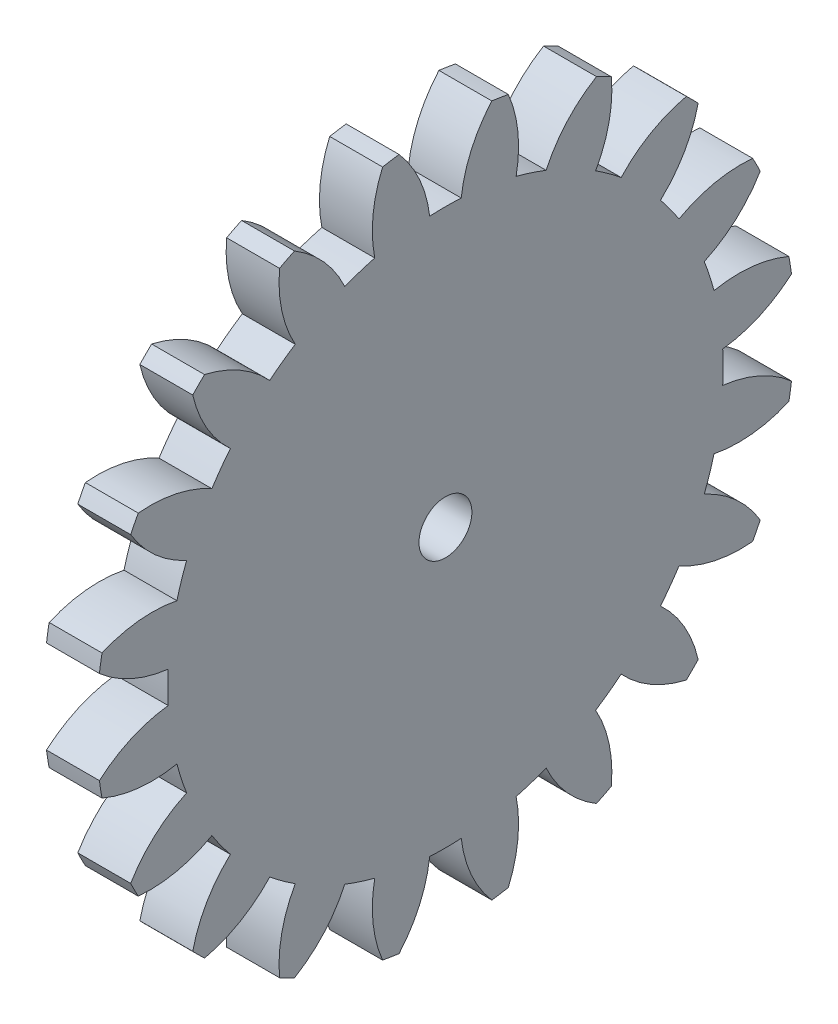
ISO-10303-21;
HEADER;
FILE_DESCRIPTION(('STEP AP214'),'2;1');
FILE_NAME('part.step','',(''),(''),'','','');
FILE_SCHEMA(('AUTOMOTIVE_DESIGN { 1 0 10303 214 1 1 1 1 }'));
ENDSEC;
DATA;
#1=APPLICATION_CONTEXT('core data for automotive mechanical design processes');
#2=APPLICATION_PROTOCOL_DEFINITION('international standard','automotive_design',2000,#1);
#3=PRODUCT_CONTEXT('',#1,'mechanical');
#4=PRODUCT('Part','Part','',(#3));
#5=PRODUCT_RELATED_PRODUCT_CATEGORY('part','',(#4));
#6=PRODUCT_DEFINITION_FORMATION('','',#4);
#7=PRODUCT_DEFINITION_CONTEXT('part definition',#1,'design');
#8=PRODUCT_DEFINITION('design','',#6,#7);
#9=PRODUCT_DEFINITION_SHAPE('','',#8);
#10=(LENGTH_UNIT() NAMED_UNIT(*) SI_UNIT(.MILLI.,.METRE.));
#11=(NAMED_UNIT(*) PLANE_ANGLE_UNIT() SI_UNIT($,.RADIAN.));
#12=(NAMED_UNIT(*) SI_UNIT($,.STERADIAN.) SOLID_ANGLE_UNIT());
#13=UNCERTAINTY_MEASURE_WITH_UNIT(LENGTH_MEASURE(1.E-05),#10,'distance_accuracy_value','');
#14=(GEOMETRIC_REPRESENTATION_CONTEXT(3) GLOBAL_UNCERTAINTY_ASSIGNED_CONTEXT((#13)) GLOBAL_UNIT_ASSIGNED_CONTEXT((#10,
#11,#12)) REPRESENTATION_CONTEXT('',''));
#15=CARTESIAN_POINT('',(0.,0.,0.));
#16=DIRECTION('',(0.,0.,1.));
#17=DIRECTION('',(1.,0.,0.));
#18=AXIS2_PLACEMENT_3D('',#15,#16,#17);
#19=CARTESIAN_POINT('',(5.,0.,0.));
#20=DIRECTION('',(-1.,0.,0.));
#21=DIRECTION('',(0.,0.,1.));
#22=AXIS2_PLACEMENT_3D('',#19,#20,#21);
#23=PLANE('',#22);
#24=CARTESIAN_POINT('',(5.,19.4423930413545,-20.4135580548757));
#25=DIRECTION('',(-1.,0.,0.));
#26=DIRECTION('',(0.,-0.309016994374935,-0.951056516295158));
#27=AXIS2_PLACEMENT_3D('',#24,#25,#26);
#28=CIRCLE('',#27,12.);
#29=CARTESIAN_POINT('',(5.,24.4638570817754,-9.51470954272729));
#30=VERTEX_POINT('',#29);
#31=CARTESIAN_POINT('',(5.,29.7530505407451,-14.2743120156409));
#32=VERTEX_POINT('',#31);
#33=EDGE_CURVE('E541',#30,#32,#28,.T.);
#34=ORIENTED_EDGE('',*,*,#33,.F.);
#35=CARTESIAN_POINT('',(5.,0.,0.));
#36=DIRECTION('',(-1.,0.,0.));
#37=DIRECTION('',(0.,-0.309016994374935,-0.951056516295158));
#38=AXIS2_PLACEMENT_3D('',#35,#36,#37);
#39=CIRCLE('',#38,26.249);
#40=CARTESIAN_POINT('',(5.,25.384282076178,-6.68193269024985));
#41=VERTEX_POINT('',#40);
#42=EDGE_CURVE('E984',#41,#30,#39,.T.);
#43=ORIENTED_EDGE('',*,*,#42,.F.);
#44=CARTESIAN_POINT('',(5.,27.728014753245,5.08696348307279));
#45=DIRECTION('',(-1.,0.,0.));
#46=DIRECTION('',(0.,-0.309016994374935,-0.951056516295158));
#47=AXIS2_PLACEMENT_3D('',#44,#45,#46);
#48=CIRCLE('',#47,12.);
#49=CARTESIAN_POINT('',(5.,32.4609536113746,-5.94024331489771));
#50=VERTEX_POINT('',#49);
#51=EDGE_CURVE('E531',#50,#41,#48,.T.);
#52=ORIENTED_EDGE('',*,*,#51,.F.);
#53=CARTESIAN_POINT('',(5.,0.,0.));
#54=DIRECTION('',(-1.,0.,0.));
#55=DIRECTION('',(0.,0.,1.));
#56=AXIS2_PLACEMENT_3D('',#53,#54,#55);
#57=CIRCLE('',#56,33.);
#58=CARTESIAN_POINT('',(5.,32.7078375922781,-4.38147920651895));
#59=VERTEX_POINT('',#58);
#60=EDGE_CURVE('E559',#59,#50,#57,.T.);
#61=ORIENTED_EDGE('',*,*,#60,.F.);
#62=CARTESIAN_POINT('',(5.,24.7989509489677,-13.4064175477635));
#63=DIRECTION('',(-1.,0.,0.));
#64=DIRECTION('',(0.,0.,-1.));
#65=AXIS2_PLACEMENT_3D('',#62,#63,#64);
#66=CIRCLE('',#65,12.);
#67=CARTESIAN_POINT('',(5.,26.2067176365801,-1.48927892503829));
#68=VERTEX_POINT('',#67);
#69=EDGE_CURVE('E583',#68,#59,#66,.T.);
#70=ORIENTED_EDGE('',*,*,#69,.F.);
#71=CARTESIAN_POINT('',(5.,0.,0.));
#72=DIRECTION('',(-1.,0.,0.));
#73=DIRECTION('',(0.,0.,-1.));
#74=AXIS2_PLACEMENT_3D('',#71,#72,#73);
#75=CIRCLE('',#74,26.249);
#76=CARTESIAN_POINT('',(5.,26.2067176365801,1.48927892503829));
#77=VERTEX_POINT('',#76);
#78=EDGE_CURVE('E579',#77,#68,#75,.T.);
#79=ORIENTED_EDGE('',*,*,#78,.F.);
#80=CARTESIAN_POINT('',(5.,24.7989509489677,13.4064175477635));
#81=DIRECTION('',(-1.,0.,0.));
#82=DIRECTION('',(0.,0.,-1.));
#83=AXIS2_PLACEMENT_3D('',#80,#81,#82);
#84=CIRCLE('',#83,12.);
#85=CARTESIAN_POINT('',(5.,32.7078375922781,4.38147920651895));
#86=VERTEX_POINT('',#85);
#87=EDGE_CURVE('E581',#86,#77,#84,.T.);
#88=ORIENTED_EDGE('',*,*,#87,.F.);
#89=CARTESIAN_POINT('',(5.,32.4609536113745,5.94024331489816));
#90=VERTEX_POINT('',#89);
#91=EDGE_CURVE('E553',#90,#86,#57,.T.);
#92=ORIENTED_EDGE('',*,*,#91,.F.);
#93=CARTESIAN_POINT('',(5.,27.728014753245,-5.0869634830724));
#94=DIRECTION('',(-1.,0.,0.));
#95=DIRECTION('',(0.,0.309016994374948,-0.951056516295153));
#96=AXIS2_PLACEMENT_3D('',#93,#94,#95);
#97=CIRCLE('',#96,12.);
#98=CARTESIAN_POINT('',(5.,25.3842820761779,6.68193269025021));
#99=VERTEX_POINT('',#98);
#100=EDGE_CURVE('E602',#99,#90,#97,.T.);
#101=ORIENTED_EDGE('',*,*,#100,.F.);
#102=CARTESIAN_POINT('',(5.,0.,0.));
#103=DIRECTION('',(-1.,0.,0.));
#104=DIRECTION('',(0.,0.309016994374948,-0.951056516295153));
#105=AXIS2_PLACEMENT_3D('',#102,#103,#104);
#106=CIRCLE('',#105,26.249);
#107=CARTESIAN_POINT('',(5.,24.4638570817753,9.51470954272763));
#108=VERTEX_POINT('',#107);
#109=EDGE_CURVE('E598',#108,#99,#106,.T.);
#110=ORIENTED_EDGE('',*,*,#109,.F.);
#111=CARTESIAN_POINT('',(5.,19.4423930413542,20.4135580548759));
#112=DIRECTION('',(-1.,0.,0.));
#113=DIRECTION('',(0.,0.309016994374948,-0.951056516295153));
#114=AXIS2_PLACEMENT_3D('',#111,#112,#113);
#115=CIRCLE('',#114,12.);
#116=CARTESIAN_POINT('',(5.,29.7530505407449,14.2743120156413));
#117=VERTEX_POINT('',#116);
#118=EDGE_CURVE('E600',#117,#108,#115,.T.);
#119=ORIENTED_EDGE('',*,*,#118,.F.);
#120=CARTESIAN_POINT('',(5.,29.0365653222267,15.6804934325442));
#121=VERTEX_POINT('',#120);
#122=EDGE_CURVE('E557',#121,#117,#57,.T.);
#123=ORIENTED_EDGE('',*,*,#122,.F.);
#124=CARTESIAN_POINT('',(5.,27.942867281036,3.7304380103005));
#125=DIRECTION('',(-1.,0.,0.));
#126=DIRECTION('',(0.,0.587785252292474,-0.809016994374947));
#127=AXIS2_PLACEMENT_3D('',#124,#125,#126);
#128=CIRCLE('',#127,12.);
#129=CARTESIAN_POINT('',(5.,22.0770561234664,14.1990701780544));
#130=VERTEX_POINT('',#129);
#131=EDGE_CURVE('E623',#130,#121,#128,.T.);
#132=ORIENTED_EDGE('',*,*,#131,.F.);
#133=CARTESIAN_POINT('',(5.,0.,0.));
#134=DIRECTION('',(-1.,0.,0.));
#135=DIRECTION('',(0.,0.587785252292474,-0.809016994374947));
#136=AXIS2_PLACEMENT_3D('',#133,#134,#135);
#137=CIRCLE('',#136,26.249);
#138=CARTESIAN_POINT('',(5.,20.3263037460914,16.6087740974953));
#139=VERTEX_POINT('',#138);
#140=EDGE_CURVE('E619',#139,#130,#137,.T.);
#141=ORIENTED_EDGE('',*,*,#140,.F.);
#142=CARTESIAN_POINT('',(5.,12.1826782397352,25.4224772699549));
#143=DIRECTION('',(-1.,0.,0.));
#144=DIRECTION('',(0.,0.587785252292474,-0.809016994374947));
#145=AXIS2_PLACEMENT_3D('',#142,#143,#144);
#146=CIRCLE('',#145,12.);
#147=CARTESIAN_POINT('',(5.,23.8858276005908,22.7698757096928));
#148=VERTEX_POINT('',#147);
#149=EDGE_CURVE('E621',#148,#139,#146,.T.);
#150=ORIENTED_EDGE('',*,*,#149,.F.);
#151=CARTESIAN_POINT('',(5.,22.7698757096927,23.8858276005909));
#152=VERTEX_POINT('',#151);
#153=EDGE_CURVE('E1178',#152,#148,#57,.T.);
#154=ORIENTED_EDGE('',*,*,#153,.F.);
#155=CARTESIAN_POINT('',(5.,25.4224772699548,12.1826782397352));
#156=DIRECTION('',(-1.,0.,0.));
#157=DIRECTION('',(0.,0.809016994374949,-0.587785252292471));
#158=AXIS2_PLACEMENT_3D('',#155,#156,#157);
#159=CIRCLE('',#158,12.);
#160=CARTESIAN_POINT('',(5.,16.6087740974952,20.3263037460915));
#161=VERTEX_POINT('',#160);
#162=EDGE_CURVE('E645',#161,#152,#159,.T.);
#163=ORIENTED_EDGE('',*,*,#162,.F.);
#164=CARTESIAN_POINT('',(5.,0.,0.));
#165=DIRECTION('',(-1.,0.,0.));
#166=DIRECTION('',(0.,0.809016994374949,-0.587785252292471));
#167=AXIS2_PLACEMENT_3D('',#164,#165,#166);
#168=CIRCLE('',#167,26.249);
#169=CARTESIAN_POINT('',(5.,14.1990701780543,22.0770561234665));
#170=VERTEX_POINT('',#169);
#171=EDGE_CURVE('E641',#170,#161,#168,.T.);
#172=ORIENTED_EDGE('',*,*,#171,.F.);
#173=CARTESIAN_POINT('',(5.,3.7304380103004,27.942867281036));
#174=DIRECTION('',(-1.,0.,0.));
#175=DIRECTION('',(0.,0.809016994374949,-0.587785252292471));
#176=AXIS2_PLACEMENT_3D('',#173,#174,#175);
#177=CIRCLE('',#176,12.);
#178=CARTESIAN_POINT('',(5.,15.6804934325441,29.0365653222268));
#179=VERTEX_POINT('',#178);
#180=EDGE_CURVE('E643',#179,#170,#177,.T.);
#181=ORIENTED_EDGE('',*,*,#180,.F.);
#182=CARTESIAN_POINT('',(5.,14.2743120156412,29.7530505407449));
#183=VERTEX_POINT('',#182);
#184=EDGE_CURVE('E1173',#183,#179,#57,.T.);
#185=ORIENTED_EDGE('',*,*,#184,.F.);
#186=CARTESIAN_POINT('',(5.,20.4135580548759,19.4423930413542));
#187=DIRECTION('',(-1.,0.,0.));
#188=DIRECTION('',(0.,0.951056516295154,-0.309016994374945));
#189=AXIS2_PLACEMENT_3D('',#186,#187,#188);
#190=CIRCLE('',#189,12.);
#191=CARTESIAN_POINT('',(5.,9.51470954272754,24.4638570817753));
#192=VERTEX_POINT('',#191);
#193=EDGE_CURVE('E667',#192,#183,#190,.T.);
#194=ORIENTED_EDGE('',*,*,#193,.F.);
#195=CARTESIAN_POINT('',(5.,0.,0.));
#196=DIRECTION('',(-1.,0.,0.));
#197=DIRECTION('',(0.,0.951056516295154,-0.309016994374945));
#198=AXIS2_PLACEMENT_3D('',#195,#196,#197);
#199=CIRCLE('',#198,26.249);
#200=CARTESIAN_POINT('',(5.,6.68193269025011,25.3842820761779));
#201=VERTEX_POINT('',#200);
#202=EDGE_CURVE('E663',#201,#192,#199,.T.);
#203=ORIENTED_EDGE('',*,*,#202,.F.);
#204=CARTESIAN_POINT('',(5.,-5.0869634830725,27.728014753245));
#205=DIRECTION('',(-1.,0.,0.));
#206=DIRECTION('',(0.,0.951056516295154,-0.309016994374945));
#207=AXIS2_PLACEMENT_3D('',#204,#205,#206);
#208=CIRCLE('',#207,12.);
#209=CARTESIAN_POINT('',(5.,5.94024331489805,32.4609536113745));
#210=VERTEX_POINT('',#209);
#211=EDGE_CURVE('E665',#210,#201,#208,.T.);
#212=ORIENTED_EDGE('',*,*,#211,.F.);
#213=CARTESIAN_POINT('',(5.,4.38147920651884,32.7078375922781));
#214=VERTEX_POINT('',#213);
#215=EDGE_CURVE('E1168',#214,#210,#57,.T.);
#216=ORIENTED_EDGE('',*,*,#215,.F.);
#217=CARTESIAN_POINT('',(5.,13.4064175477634,24.7989509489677));
#218=DIRECTION('',(-1.,0.,0.));
#219=DIRECTION('',(0.,1.,0.));
#220=AXIS2_PLACEMENT_3D('',#217,#218,#219);
#221=CIRCLE('',#220,12.);
#222=CARTESIAN_POINT('',(5.,1.4892789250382,26.2067176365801));
#223=VERTEX_POINT('',#222);
#224=EDGE_CURVE('E689',#223,#214,#221,.T.);
#225=ORIENTED_EDGE('',*,*,#224,.F.);
#226=CARTESIAN_POINT('',(5.,0.,0.));
#227=DIRECTION('',(-1.,0.,0.));
#228=DIRECTION('',(0.,1.,0.));
#229=AXIS2_PLACEMENT_3D('',#226,#227,#228);
#230=CIRCLE('',#229,26.249);
#231=CARTESIAN_POINT('',(5.,-1.48927892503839,26.2067176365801));
#232=VERTEX_POINT('',#231);
#233=EDGE_CURVE('E685',#232,#223,#230,.T.);
#234=ORIENTED_EDGE('',*,*,#233,.F.);
#235=CARTESIAN_POINT('',(5.,-13.4064175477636,24.7989509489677));
#236=DIRECTION('',(-1.,0.,0.));
#237=DIRECTION('',(0.,1.,0.));
#238=AXIS2_PLACEMENT_3D('',#235,#236,#237);
#239=CIRCLE('',#238,12.);
#240=CARTESIAN_POINT('',(5.,-4.38147920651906,32.7078375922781));
#241=VERTEX_POINT('',#240);
#242=EDGE_CURVE('E687',#241,#232,#239,.T.);
#243=ORIENTED_EDGE('',*,*,#242,.F.);
#244=CARTESIAN_POINT('',(5.,-5.94024331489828,32.4609536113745));
#245=VERTEX_POINT('',#244);
#246=EDGE_CURVE('E1163',#245,#241,#57,.T.);
#247=ORIENTED_EDGE('',*,*,#246,.F.);
#248=CARTESIAN_POINT('',(5.,5.0869634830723,27.7280147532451));
#249=DIRECTION('',(-1.,0.,0.));
#250=DIRECTION('',(0.,0.951056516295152,0.309016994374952));
#251=AXIS2_PLACEMENT_3D('',#248,#249,#250);
#252=CIRCLE('',#251,12.);
#253=CARTESIAN_POINT('',(5.,-6.6819326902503,25.3842820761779));
#254=VERTEX_POINT('',#253);
#255=EDGE_CURVE('E711',#254,#245,#252,.T.);
#256=ORIENTED_EDGE('',*,*,#255,.F.);
#257=CARTESIAN_POINT('',(5.,0.,0.));
#258=DIRECTION('',(-1.,0.,0.));
#259=DIRECTION('',(0.,0.951056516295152,0.309016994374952));
#260=AXIS2_PLACEMENT_3D('',#257,#258,#259);
#261=CIRCLE('',#260,26.249);
#262=CARTESIAN_POINT('',(5.,-9.51470954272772,24.4638570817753));
#263=VERTEX_POINT('',#262);
#264=EDGE_CURVE('E707',#263,#254,#261,.T.);
#265=ORIENTED_EDGE('',*,*,#264,.F.);
#266=CARTESIAN_POINT('',(5.,-20.413558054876,19.4423930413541));
#267=DIRECTION('',(-1.,0.,0.));
#268=DIRECTION('',(0.,0.951056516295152,0.309016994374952));
#269=AXIS2_PLACEMENT_3D('',#266,#267,#268);
#270=CIRCLE('',#269,12.);
#271=CARTESIAN_POINT('',(5.,-14.2743120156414,29.7530505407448));
#272=VERTEX_POINT('',#271);
#273=EDGE_CURVE('E709',#272,#263,#270,.T.);
#274=ORIENTED_EDGE('',*,*,#273,.F.);
#275=CARTESIAN_POINT('',(5.,-15.6804934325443,29.0365653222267));
#276=VERTEX_POINT('',#275);
#277=EDGE_CURVE('E1158',#276,#272,#57,.T.);
#278=ORIENTED_EDGE('',*,*,#277,.F.);
#279=CARTESIAN_POINT('',(5.,-3.7304380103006,27.942867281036));
#280=DIRECTION('',(-1.,0.,0.));
#281=DIRECTION('',(0.,0.809016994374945,0.587785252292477));
#282=AXIS2_PLACEMENT_3D('',#279,#280,#281);
#283=CIRCLE('',#282,12.);
#284=CARTESIAN_POINT('',(5.,-14.1990701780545,22.0770561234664));
#285=VERTEX_POINT('',#284);
#286=EDGE_CURVE('E733',#285,#276,#283,.T.);
#287=ORIENTED_EDGE('',*,*,#286,.F.);
#288=CARTESIAN_POINT('',(5.,0.,0.));
#289=DIRECTION('',(-1.,0.,0.));
#290=DIRECTION('',(0.,0.809016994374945,0.587785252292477));
#291=AXIS2_PLACEMENT_3D('',#288,#289,#290);
#292=CIRCLE('',#291,26.249);
#293=CARTESIAN_POINT('',(5.,-16.6087740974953,20.3263037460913));
#294=VERTEX_POINT('',#293);
#295=EDGE_CURVE('E729',#294,#285,#292,.T.);
#296=ORIENTED_EDGE('',*,*,#295,.F.);
#297=CARTESIAN_POINT('',(5.,-25.4224772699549,12.1826782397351));
#298=DIRECTION('',(-1.,0.,0.));
#299=DIRECTION('',(0.,0.809016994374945,0.587785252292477));
#300=AXIS2_PLACEMENT_3D('',#297,#298,#299);
#301=CIRCLE('',#300,12.);
#302=CARTESIAN_POINT('',(5.,-22.7698757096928,23.8858276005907));
#303=VERTEX_POINT('',#302);
#304=EDGE_CURVE('E731',#303,#294,#301,.T.);
#305=ORIENTED_EDGE('',*,*,#304,.F.);
#306=CARTESIAN_POINT('',(5.,-23.8858276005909,22.7698757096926));
#307=VERTEX_POINT('',#306);
#308=EDGE_CURVE('E1153',#307,#303,#57,.T.);
#309=ORIENTED_EDGE('',*,*,#308,.F.);
#310=CARTESIAN_POINT('',(5.,-12.1826782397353,25.4224772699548));
#311=DIRECTION('',(-1.,0.,0.));
#312=DIRECTION('',(0.,0.587785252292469,0.809016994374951));
#313=AXIS2_PLACEMENT_3D('',#310,#311,#312);
#314=CIRCLE('',#313,12.);
#315=CARTESIAN_POINT('',(5.,-20.3263037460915,16.6087740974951));
#316=VERTEX_POINT('',#315);
#317=EDGE_CURVE('E755',#316,#307,#314,.T.);
#318=ORIENTED_EDGE('',*,*,#317,.F.);
#319=CARTESIAN_POINT('',(5.,0.,0.));
#320=DIRECTION('',(-1.,0.,0.));
#321=DIRECTION('',(0.,0.587785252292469,0.809016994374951));
#322=AXIS2_PLACEMENT_3D('',#319,#320,#321);
#323=CIRCLE('',#322,26.249);
#324=CARTESIAN_POINT('',(5.,-22.0770561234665,14.1990701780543));
#325=VERTEX_POINT('',#324);
#326=EDGE_CURVE('E751',#325,#316,#323,.T.);
#327=ORIENTED_EDGE('',*,*,#326,.F.);
#328=CARTESIAN_POINT('',(5.,-27.942867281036,3.73043801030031));
#329=DIRECTION('',(-1.,0.,0.));
#330=DIRECTION('',(0.,0.587785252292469,0.809016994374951));
#331=AXIS2_PLACEMENT_3D('',#328,#329,#330);
#332=CIRCLE('',#331,12.);
#333=CARTESIAN_POINT('',(5.,-29.0365653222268,15.680493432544));
#334=VERTEX_POINT('',#333);
#335=EDGE_CURVE('E753',#334,#325,#332,.T.);
#336=ORIENTED_EDGE('',*,*,#335,.F.);
#337=CARTESIAN_POINT('',(5.,-29.753050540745,14.2743120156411));
#338=VERTEX_POINT('',#337);
#339=EDGE_CURVE('E1148',#338,#334,#57,.T.);
#340=ORIENTED_EDGE('',*,*,#339,.F.);
#341=CARTESIAN_POINT('',(5.,-19.4423930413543,20.4135580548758));
#342=DIRECTION('',(-1.,0.,0.));
#343=DIRECTION('',(0.,0.309016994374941,0.951056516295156));
#344=AXIS2_PLACEMENT_3D('',#341,#342,#343);
#345=CIRCLE('',#344,12.);
#346=CARTESIAN_POINT('',(5.,-24.4638570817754,9.51470954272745));
#347=VERTEX_POINT('',#346);
#348=EDGE_CURVE('E777',#347,#338,#345,.T.);
#349=ORIENTED_EDGE('',*,*,#348,.F.);
#350=CARTESIAN_POINT('',(5.,0.,0.));
#351=DIRECTION('',(-1.,0.,0.));
#352=DIRECTION('',(0.,0.309016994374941,0.951056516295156));
#353=AXIS2_PLACEMENT_3D('',#350,#351,#352);
#354=CIRCLE('',#353,26.249);
#355=CARTESIAN_POINT('',(5.,-25.3842820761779,6.68193269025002));
#356=VERTEX_POINT('',#355);
#357=EDGE_CURVE('E773',#356,#347,#354,.T.);
#358=ORIENTED_EDGE('',*,*,#357,.F.);
#359=CARTESIAN_POINT('',(5.,-27.728014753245,-5.08696348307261));
#360=DIRECTION('',(-1.,0.,0.));
#361=DIRECTION('',(0.,0.309016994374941,0.951056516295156));
#362=AXIS2_PLACEMENT_3D('',#359,#360,#361);
#363=CIRCLE('',#362,12.);
#364=CARTESIAN_POINT('',(5.,-32.4609536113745,5.94024331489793));
#365=VERTEX_POINT('',#364);
#366=EDGE_CURVE('E775',#365,#356,#363,.T.);
#367=ORIENTED_EDGE('',*,*,#366,.F.);
#368=CARTESIAN_POINT('',(5.,-32.7078375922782,4.38147920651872));
#369=VERTEX_POINT('',#368);
#370=EDGE_CURVE('E1143',#369,#365,#57,.T.);
#371=ORIENTED_EDGE('',*,*,#370,.F.);
#372=CARTESIAN_POINT('',(5.,-24.7989509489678,13.4064175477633));
#373=DIRECTION('',(-1.,0.,0.));
#374=DIRECTION('',(0.,0.,1.));
#375=AXIS2_PLACEMENT_3D('',#372,#373,#374);
#376=CIRCLE('',#375,12.);
#377=CARTESIAN_POINT('',(5.,-26.2067176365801,1.48927892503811));
#378=VERTEX_POINT('',#377);
#379=EDGE_CURVE('E799',#378,#369,#376,.T.);
#380=ORIENTED_EDGE('',*,*,#379,.F.);
#381=CARTESIAN_POINT('',(5.,0.,0.));
#382=DIRECTION('',(-1.,0.,0.));
#383=DIRECTION('',(0.,0.,1.));
#384=AXIS2_PLACEMENT_3D('',#381,#382,#383);
#385=CIRCLE('',#384,26.249);
#386=CARTESIAN_POINT('',(5.,-26.2067176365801,-1.48927892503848));
#387=VERTEX_POINT('',#386);
#388=EDGE_CURVE('E795',#387,#378,#385,.T.);
#389=ORIENTED_EDGE('',*,*,#388,.F.);
#390=CARTESIAN_POINT('',(5.,-24.7989509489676,-13.4064175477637));
#391=DIRECTION('',(-1.,0.,0.));
#392=DIRECTION('',(0.,0.,1.));
#393=AXIS2_PLACEMENT_3D('',#390,#391,#392);
#394=CIRCLE('',#393,12.);
#395=CARTESIAN_POINT('',(5.,-32.7078375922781,-4.38147920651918));
#396=VERTEX_POINT('',#395);
#397=EDGE_CURVE('E797',#396,#387,#394,.T.);
#398=ORIENTED_EDGE('',*,*,#397,.F.);
#399=CARTESIAN_POINT('',(5.,-32.4609536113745,-5.94024331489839));
#400=VERTEX_POINT('',#399);
#401=EDGE_CURVE('E1138',#400,#396,#57,.T.);
#402=ORIENTED_EDGE('',*,*,#401,.F.);
#403=CARTESIAN_POINT('',(5.,-27.7280147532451,5.0869634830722));
#404=DIRECTION('',(-1.,0.,0.));
#405=DIRECTION('',(0.,-0.309016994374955,0.951056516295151));
#406=AXIS2_PLACEMENT_3D('',#403,#404,#405);
#407=CIRCLE('',#406,12.);
#408=CARTESIAN_POINT('',(5.,-25.3842820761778,-6.68193269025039));
#409=VERTEX_POINT('',#408);
#410=EDGE_CURVE('E821',#409,#400,#407,.T.);
#411=ORIENTED_EDGE('',*,*,#410,.F.);
#412=CARTESIAN_POINT('',(5.,0.,0.));
#413=DIRECTION('',(-1.,0.,0.));
#414=DIRECTION('',(0.,-0.309016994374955,0.951056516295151));
#415=AXIS2_PLACEMENT_3D('',#412,#413,#414);
#416=CIRCLE('',#415,26.249);
#417=CARTESIAN_POINT('',(5.,-24.4638570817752,-9.5147095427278));
#418=VERTEX_POINT('',#417);
#419=EDGE_CURVE('E817',#418,#409,#416,.T.);
#420=ORIENTED_EDGE('',*,*,#419,.F.);
#421=CARTESIAN_POINT('',(5.,-19.442393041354,-20.4135580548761));
#422=DIRECTION('',(-1.,0.,0.));
#423=DIRECTION('',(0.,-0.309016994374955,0.951056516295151));
#424=AXIS2_PLACEMENT_3D('',#421,#422,#423);
#425=CIRCLE('',#424,12.);
#426=CARTESIAN_POINT('',(5.,-29.7530505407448,-14.2743120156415));
#427=VERTEX_POINT('',#426);
#428=EDGE_CURVE('E819',#427,#418,#425,.T.);
#429=ORIENTED_EDGE('',*,*,#428,.F.);
#430=CARTESIAN_POINT('',(5.,-29.0365653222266,-15.6804934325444));
#431=VERTEX_POINT('',#430);
#432=EDGE_CURVE('E1133',#431,#427,#57,.T.);
#433=ORIENTED_EDGE('',*,*,#432,.F.);
#434=CARTESIAN_POINT('',(5.,-27.942867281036,-3.73043801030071));
#435=DIRECTION('',(-1.,0.,0.));
#436=DIRECTION('',(0.,-0.58778525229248,0.809016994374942));
#437=AXIS2_PLACEMENT_3D('',#434,#435,#436);
#438=CIRCLE('',#437,12.);
#439=CARTESIAN_POINT('',(5.,-22.0770561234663,-14.1990701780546));
#440=VERTEX_POINT('',#439);
#441=EDGE_CURVE('E843',#440,#431,#438,.T.);
#442=ORIENTED_EDGE('',*,*,#441,.F.);
#443=CARTESIAN_POINT('',(5.,0.,0.));
#444=DIRECTION('',(-1.,0.,0.));
#445=DIRECTION('',(0.,-0.58778525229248,0.809016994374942));
#446=AXIS2_PLACEMENT_3D('',#443,#444,#445);
#447=CIRCLE('',#446,26.249);
#448=CARTESIAN_POINT('',(5.,-20.3263037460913,-16.6087740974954));
#449=VERTEX_POINT('',#448);
#450=EDGE_CURVE('E839',#449,#440,#447,.T.);
#451=ORIENTED_EDGE('',*,*,#450,.F.);
#452=CARTESIAN_POINT('',(5.,-12.182678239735,-25.4224772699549));
#453=DIRECTION('',(-1.,0.,0.));
#454=DIRECTION('',(0.,-0.58778525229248,0.809016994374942));
#455=AXIS2_PLACEMENT_3D('',#452,#453,#454);
#456=CIRCLE('',#455,12.);
#457=CARTESIAN_POINT('',(5.,-23.8858276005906,-22.7698757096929));
#458=VERTEX_POINT('',#457);
#459=EDGE_CURVE('E841',#458,#449,#456,.T.);
#460=ORIENTED_EDGE('',*,*,#459,.F.);
#461=CARTESIAN_POINT('',(5.,-22.7698757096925,-23.885827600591));
#462=VERTEX_POINT('',#461);
#463=EDGE_CURVE('E1128',#462,#458,#57,.T.);
#464=ORIENTED_EDGE('',*,*,#463,.F.);
#465=CARTESIAN_POINT('',(5.,-25.4224772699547,-12.1826782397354));
#466=DIRECTION('',(-1.,0.,0.));
#467=DIRECTION('',(0.,-0.809016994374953,0.587785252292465));
#468=AXIS2_PLACEMENT_3D('',#465,#466,#467);
#469=CIRCLE('',#468,12.);
#470=CARTESIAN_POINT('',(5.,-16.6087740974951,-20.3263037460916));
#471=VERTEX_POINT('',#470);
#472=EDGE_CURVE('E865',#471,#462,#469,.T.);
#473=ORIENTED_EDGE('',*,*,#472,.F.);
#474=CARTESIAN_POINT('',(5.,0.,0.));
#475=DIRECTION('',(-1.,0.,0.));
#476=DIRECTION('',(0.,-0.809016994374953,0.587785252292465));
#477=AXIS2_PLACEMENT_3D('',#474,#475,#476);
#478=CIRCLE('',#477,26.249);
#479=CARTESIAN_POINT('',(5.,-14.1990701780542,-22.0770561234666));
#480=VERTEX_POINT('',#479);
#481=EDGE_CURVE('E861',#480,#471,#478,.T.);
#482=ORIENTED_EDGE('',*,*,#481,.F.);
#483=CARTESIAN_POINT('',(5.,-3.7304380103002,-27.942867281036));
#484=DIRECTION('',(-1.,0.,0.));
#485=DIRECTION('',(0.,-0.809016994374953,0.587785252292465));
#486=AXIS2_PLACEMENT_3D('',#483,#484,#485);
#487=CIRCLE('',#486,12.);
#488=CARTESIAN_POINT('',(5.,-15.6804934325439,-29.0365653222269));
#489=VERTEX_POINT('',#488);
#490=EDGE_CURVE('E863',#489,#480,#487,.T.);
#491=ORIENTED_EDGE('',*,*,#490,.F.);
#492=CARTESIAN_POINT('',(5.,-14.274312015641,-29.753050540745));
#493=VERTEX_POINT('',#492);
#494=EDGE_CURVE('E1123',#493,#489,#57,.T.);
#495=ORIENTED_EDGE('',*,*,#494,.F.);
#496=CARTESIAN_POINT('',(5.,-20.4135580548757,-19.4423930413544));
#497=DIRECTION('',(-1.,0.,0.));
#498=DIRECTION('',(0.,-0.951056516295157,0.309016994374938));
#499=AXIS2_PLACEMENT_3D('',#496,#497,#498);
#500=CIRCLE('',#499,12.);
#501=CARTESIAN_POINT('',(5.,-9.51470954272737,-24.4638570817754));
#502=VERTEX_POINT('',#501);
#503=EDGE_CURVE('E887',#502,#493,#500,.T.);
#504=ORIENTED_EDGE('',*,*,#503,.F.);
#505=CARTESIAN_POINT('',(5.,0.,0.));
#506=DIRECTION('',(-1.,0.,0.));
#507=DIRECTION('',(0.,-0.951056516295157,0.309016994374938));
#508=AXIS2_PLACEMENT_3D('',#505,#506,#507);
#509=CIRCLE('',#508,26.249);
#510=CARTESIAN_POINT('',(5.,-6.68193269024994,-25.3842820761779));
#511=VERTEX_POINT('',#510);
#512=EDGE_CURVE('E883',#511,#502,#509,.T.);
#513=ORIENTED_EDGE('',*,*,#512,.F.);
#514=CARTESIAN_POINT('',(5.,5.08696348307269,-27.728014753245));
#515=DIRECTION('',(-1.,0.,0.));
#516=DIRECTION('',(0.,-0.951056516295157,0.309016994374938));
#517=AXIS2_PLACEMENT_3D('',#514,#515,#516);
#518=CIRCLE('',#517,12.);
#519=CARTESIAN_POINT('',(5.,-5.94024331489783,-32.4609536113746));
#520=VERTEX_POINT('',#519);
#521=EDGE_CURVE('E885',#520,#511,#518,.T.);
#522=ORIENTED_EDGE('',*,*,#521,.F.);
#523=CARTESIAN_POINT('',(5.,-4.38147920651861,-32.7078375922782));
#524=VERTEX_POINT('',#523);
#525=EDGE_CURVE('E1118',#524,#520,#57,.T.);
#526=ORIENTED_EDGE('',*,*,#525,.F.);
#527=CARTESIAN_POINT('',(5.,-13.4064175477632,-24.7989509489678));
#528=DIRECTION('',(-1.,0.,0.));
#529=DIRECTION('',(0.,-1.,0.));
#530=AXIS2_PLACEMENT_3D('',#527,#528,#529);
#531=CIRCLE('',#530,12.);
#532=CARTESIAN_POINT('',(5.,-1.48927892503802,-26.2067176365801));
#533=VERTEX_POINT('',#532);
#534=EDGE_CURVE('E909',#533,#524,#531,.T.);
#535=ORIENTED_EDGE('',*,*,#534,.F.);
#536=CARTESIAN_POINT('',(5.,0.,0.));
#537=DIRECTION('',(-1.,0.,0.));
#538=DIRECTION('',(0.,-1.,0.));
#539=AXIS2_PLACEMENT_3D('',#536,#537,#538);
#540=CIRCLE('',#539,26.249);
#541=CARTESIAN_POINT('',(5.,1.48927892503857,-26.20671763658));
#542=VERTEX_POINT('',#541);
#543=EDGE_CURVE('E905',#542,#533,#540,.T.);
#544=ORIENTED_EDGE('',*,*,#543,.F.);
#545=CARTESIAN_POINT('',(5.,13.4064175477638,-24.7989509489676));
#546=DIRECTION('',(-1.,0.,0.));
#547=DIRECTION('',(0.,-1.,0.));
#548=AXIS2_PLACEMENT_3D('',#545,#546,#547);
#549=CIRCLE('',#548,12.);
#550=CARTESIAN_POINT('',(5.,4.38147920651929,-32.7078375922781));
#551=VERTEX_POINT('',#550);
#552=EDGE_CURVE('E907',#551,#542,#549,.T.);
#553=ORIENTED_EDGE('',*,*,#552,.F.);
#554=CARTESIAN_POINT('',(5.,5.94024331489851,-32.4609536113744));
#555=VERTEX_POINT('',#554);
#556=EDGE_CURVE('E1113',#555,#551,#57,.T.);
#557=ORIENTED_EDGE('',*,*,#556,.F.);
#558=CARTESIAN_POINT('',(5.,-5.08696348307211,-27.7280147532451));
#559=DIRECTION('',(-1.,0.,0.));
#560=DIRECTION('',(0.,-0.95105651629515,-0.309016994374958));
#561=AXIS2_PLACEMENT_3D('',#558,#559,#560);
#562=CIRCLE('',#561,12.);
#563=CARTESIAN_POINT('',(5.,6.68193269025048,-25.3842820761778));
#564=VERTEX_POINT('',#563);
#565=EDGE_CURVE('E931',#564,#555,#562,.T.);
#566=ORIENTED_EDGE('',*,*,#565,.F.);
#567=CARTESIAN_POINT('',(5.,0.,0.));
#568=DIRECTION('',(-1.,0.,0.));
#569=DIRECTION('',(0.,-0.95105651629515,-0.309016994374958));
#570=AXIS2_PLACEMENT_3D('',#567,#568,#569);
#571=CIRCLE('',#570,26.249);
#572=CARTESIAN_POINT('',(5.,9.51470954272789,-24.4638570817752));
#573=VERTEX_POINT('',#572);
#574=EDGE_CURVE('E927',#573,#564,#571,.T.);
#575=ORIENTED_EDGE('',*,*,#574,.F.);
#576=CARTESIAN_POINT('',(5.,20.4135580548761,-19.442393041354));
#577=DIRECTION('',(-1.,0.,0.));
#578=DIRECTION('',(0.,-0.95105651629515,-0.309016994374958));
#579=AXIS2_PLACEMENT_3D('',#576,#577,#578);
#580=CIRCLE('',#579,12.);
#581=CARTESIAN_POINT('',(5.,14.2743120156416,-29.7530505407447));
#582=VERTEX_POINT('',#581);
#583=EDGE_CURVE('E929',#582,#573,#580,.T.);
#584=ORIENTED_EDGE('',*,*,#583,.F.);
#585=CARTESIAN_POINT('',(5.,15.6804934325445,-29.0365653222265));
#586=VERTEX_POINT('',#585);
#587=EDGE_CURVE('E1108',#586,#582,#57,.T.);
#588=ORIENTED_EDGE('',*,*,#587,.F.);
#589=CARTESIAN_POINT('',(5.,3.73043801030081,-27.942867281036));
#590=DIRECTION('',(-1.,0.,0.));
#591=DIRECTION('',(0.,-0.80901699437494,-0.587785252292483));
#592=AXIS2_PLACEMENT_3D('',#589,#590,#591);
#593=CIRCLE('',#592,12.);
#594=CARTESIAN_POINT('',(5.,14.1990701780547,-22.0770561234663));
#595=VERTEX_POINT('',#594);
#596=EDGE_CURVE('E953',#595,#586,#593,.T.);
#597=ORIENTED_EDGE('',*,*,#596,.F.);
#598=CARTESIAN_POINT('',(5.,0.,0.));
#599=DIRECTION('',(-1.,0.,0.));
#600=DIRECTION('',(0.,-0.80901699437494,-0.587785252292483));
#601=AXIS2_PLACEMENT_3D('',#598,#599,#600);
#602=CIRCLE('',#601,26.249);
#603=CARTESIAN_POINT('',(5.,16.6087740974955,-20.3263037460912));
#604=VERTEX_POINT('',#603);
#605=EDGE_CURVE('E949',#604,#595,#602,.T.);
#606=ORIENTED_EDGE('',*,*,#605,.F.);
#607=CARTESIAN_POINT('',(5.,25.422477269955,-12.1826782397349));
#608=DIRECTION('',(-1.,0.,0.));
#609=DIRECTION('',(0.,-0.80901699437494,-0.587785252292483));
#610=AXIS2_PLACEMENT_3D('',#607,#608,#609);
#611=CIRCLE('',#610,12.);
#612=CARTESIAN_POINT('',(5.,22.769875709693,-23.8858276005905));
#613=VERTEX_POINT('',#612);
#614=EDGE_CURVE('E951',#613,#604,#611,.T.);
#615=ORIENTED_EDGE('',*,*,#614,.F.);
#616=CARTESIAN_POINT('',(5.,23.8858276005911,-22.7698757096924));
#617=VERTEX_POINT('',#616);
#618=EDGE_CURVE('E1107',#617,#613,#57,.T.);
#619=ORIENTED_EDGE('',*,*,#618,.F.);
#620=CARTESIAN_POINT('',(5.,12.1826782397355,-25.4224772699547));
#621=DIRECTION('',(-1.,0.,0.));
#622=DIRECTION('',(0.,-0.587785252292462,-0.809016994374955));
#623=AXIS2_PLACEMENT_3D('',#620,#621,#622);
#624=CIRCLE('',#623,12.);
#625=CARTESIAN_POINT('',(5.,20.3263037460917,-16.608774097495));
#626=VERTEX_POINT('',#625);
#627=EDGE_CURVE('E974',#626,#617,#624,.T.);
#628=ORIENTED_EDGE('',*,*,#627,.F.);
#629=CARTESIAN_POINT('',(5.,0.,0.));
#630=DIRECTION('',(-1.,0.,0.));
#631=DIRECTION('',(0.,-0.587785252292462,-0.809016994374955));
#632=AXIS2_PLACEMENT_3D('',#629,#630,#631);
#633=CIRCLE('',#632,26.249);
#634=CARTESIAN_POINT('',(5.,22.0770561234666,-14.1990701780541));
#635=VERTEX_POINT('',#634);
#636=EDGE_CURVE('E970',#635,#626,#633,.T.);
#637=ORIENTED_EDGE('',*,*,#636,.F.);
#638=CARTESIAN_POINT('',(5.,27.9428672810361,-3.7304380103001));
#639=DIRECTION('',(-1.,0.,0.));
#640=DIRECTION('',(0.,-0.587785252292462,-0.809016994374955));
#641=AXIS2_PLACEMENT_3D('',#638,#639,#640);
#642=CIRCLE('',#641,12.);
#643=CARTESIAN_POINT('',(5.,29.0365653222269,-15.6804934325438));
#644=VERTEX_POINT('',#643);
#645=EDGE_CURVE('E972',#644,#635,#642,.T.);
#646=ORIENTED_EDGE('',*,*,#645,.F.);
#647=EDGE_CURVE('E1047',#32,#644,#57,.T.);
#648=ORIENTED_EDGE('',*,*,#647,.F.);
#649=EDGE_LOOP('',(#34,#43,#52,#61,#70,#79,#88,#92,#101,#110,#119,#123,#132,#141,#150,#154,#163,
#172,#181,#185,#194,#203,#212,#216,#225,#234,#243,#247,#256,#265,#274,#278,#287,#296,#305,#309,
#318,#327,#336,#340,#349,#358,#367,#371,#380,#389,#398,#402,#411,#420,#429,#433,#442,#451,#460,
#464,#473,#482,#491,#495,#504,#513,#522,#526,#535,#544,#553,#557,#566,#575,#584,#588,#597,#606,
#615,#619,#628,#637,#646,#648));
#650=FACE_BOUND('',#649,.T.);
#651=CARTESIAN_POINT('',(5.,0.,0.));
#652=DIRECTION('',(-1.,0.,0.));
#653=DIRECTION('',(0.,0.,1.));
#654=AXIS2_PLACEMENT_3D('',#651,#652,#653);
#655=CIRCLE('',#654,2.5);
#656=CARTESIAN_POINT('',(5.,0.,2.5));
#657=VERTEX_POINT('',#656);
#658=EDGE_CURVE('E989',#657,#657,#655,.F.);
#659=ORIENTED_EDGE('',*,*,#658,.F.);
#660=EDGE_LOOP('',(#659));
#661=FACE_BOUND('',#660,.T.);
#662=ADVANCED_FACE('F28',(#650,#661),#23,.F.);
#663=CARTESIAN_POINT('',(0.,0.,0.));
#664=DIRECTION('',(1.,0.,0.));
#665=DIRECTION('',(0.,0.,-1.));
#666=AXIS2_PLACEMENT_3D('',#663,#664,#665);
#667=PLANE('',#666);
#668=CARTESIAN_POINT('',(0.,19.4423930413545,-20.4135580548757));
#669=DIRECTION('',(-1.,0.,0.));
#670=DIRECTION('',(0.,-0.309016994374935,-0.951056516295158));
#671=AXIS2_PLACEMENT_3D('',#668,#669,#670);
#672=CIRCLE('',#671,12.);
#673=CARTESIAN_POINT('',(0.,24.4638570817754,-9.51470954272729));
#674=VERTEX_POINT('',#673);
#675=CARTESIAN_POINT('',(0.,29.7530505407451,-14.2743120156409));
#676=VERTEX_POINT('',#675);
#677=EDGE_CURVE('E43',#674,#676,#672,.T.);
#678=ORIENTED_EDGE('',*,*,#677,.T.);
#679=CARTESIAN_POINT('',(0.,0.,0.));
#680=DIRECTION('',(-1.,0.,0.));
#681=DIRECTION('',(0.,0.,1.));
#682=AXIS2_PLACEMENT_3D('',#679,#680,#681);
#683=CIRCLE('',#682,33.);
#684=CARTESIAN_POINT('',(0.,29.0365653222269,-15.6804934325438));
#685=VERTEX_POINT('',#684);
#686=EDGE_CURVE('E554',#676,#685,#683,.T.);
#687=ORIENTED_EDGE('',*,*,#686,.T.);
#688=CARTESIAN_POINT('',(0.,27.9428672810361,-3.7304380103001));
#689=DIRECTION('',(1.,0.,0.));
#690=DIRECTION('',(0.,0.,-1.));
#691=AXIS2_PLACEMENT_3D('',#688,#689,#690);
#692=CIRCLE('',#691,12.);
#693=CARTESIAN_POINT('',(0.,22.0770561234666,-14.1990701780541));
#694=VERTEX_POINT('',#693);
#695=EDGE_CURVE('E36',#694,#685,#692,.T.);
#696=ORIENTED_EDGE('',*,*,#695,.F.);
#697=CARTESIAN_POINT('',(0.,0.,0.));
#698=DIRECTION('',(-1.,0.,0.));
#699=DIRECTION('',(0.,-0.587785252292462,-0.809016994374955));
#700=AXIS2_PLACEMENT_3D('',#697,#698,#699);
#701=CIRCLE('',#700,26.249);
#702=CARTESIAN_POINT('',(0.,20.3263037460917,-16.608774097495));
#703=VERTEX_POINT('',#702);
#704=EDGE_CURVE('E976',#694,#703,#701,.T.);
#705=ORIENTED_EDGE('',*,*,#704,.T.);
#706=CARTESIAN_POINT('',(0.,12.1826782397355,-25.4224772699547));
#707=DIRECTION('',(-1.,0.,0.));
#708=DIRECTION('',(0.,-0.587785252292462,-0.809016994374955));
#709=AXIS2_PLACEMENT_3D('',#706,#707,#708);
#710=CIRCLE('',#709,12.);
#711=CARTESIAN_POINT('',(0.,23.8858276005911,-22.7698757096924));
#712=VERTEX_POINT('',#711);
#713=EDGE_CURVE('E51',#703,#712,#710,.T.);
#714=ORIENTED_EDGE('',*,*,#713,.T.);
#715=CARTESIAN_POINT('',(0.,22.769875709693,-23.8858276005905));
#716=VERTEX_POINT('',#715);
#717=EDGE_CURVE('E560',#712,#716,#683,.T.);
#718=ORIENTED_EDGE('',*,*,#717,.T.);
#719=CARTESIAN_POINT('',(0.,25.422477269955,-12.1826782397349));
#720=DIRECTION('',(1.,0.,0.));
#721=DIRECTION('',(0.,0.,-1.));
#722=AXIS2_PLACEMENT_3D('',#719,#720,#721);
#723=CIRCLE('',#722,12.);
#724=CARTESIAN_POINT('',(0.,16.6087740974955,-20.3263037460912));
#725=VERTEX_POINT('',#724);
#726=EDGE_CURVE('E1093',#725,#716,#723,.T.);
#727=ORIENTED_EDGE('',*,*,#726,.F.);
#728=CARTESIAN_POINT('',(0.,0.,0.));
#729=DIRECTION('',(-1.,0.,0.));
#730=DIRECTION('',(0.,-0.80901699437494,-0.587785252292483));
#731=AXIS2_PLACEMENT_3D('',#728,#729,#730);
#732=CIRCLE('',#731,26.249);
#733=CARTESIAN_POINT('',(0.,14.1990701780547,-22.0770561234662));
#734=VERTEX_POINT('',#733);
#735=EDGE_CURVE('E955',#725,#734,#732,.T.);
#736=ORIENTED_EDGE('',*,*,#735,.T.);
#737=CARTESIAN_POINT('',(0.,3.73043801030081,-27.942867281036));
#738=DIRECTION('',(-1.,0.,0.));
#739=DIRECTION('',(0.,-0.80901699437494,-0.587785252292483));
#740=AXIS2_PLACEMENT_3D('',#737,#738,#739);
#741=CIRCLE('',#740,12.);
#742=CARTESIAN_POINT('',(0.,15.6804934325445,-29.0365653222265));
#743=VERTEX_POINT('',#742);
#744=EDGE_CURVE('E958',#734,#743,#741,.T.);
#745=ORIENTED_EDGE('',*,*,#744,.T.);
#746=CARTESIAN_POINT('',(0.,14.2743120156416,-29.7530505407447));
#747=VERTEX_POINT('',#746);
#748=EDGE_CURVE('E1253',#743,#747,#683,.T.);
#749=ORIENTED_EDGE('',*,*,#748,.T.);
#750=CARTESIAN_POINT('',(0.,20.4135580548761,-19.442393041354));
#751=DIRECTION('',(1.,0.,0.));
#752=DIRECTION('',(0.,0.,-1.));
#753=AXIS2_PLACEMENT_3D('',#750,#751,#752);
#754=CIRCLE('',#753,12.);
#755=CARTESIAN_POINT('',(0.,9.51470954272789,-24.4638570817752));
#756=VERTEX_POINT('',#755);
#757=EDGE_CURVE('E1090',#756,#747,#754,.T.);
#758=ORIENTED_EDGE('',*,*,#757,.F.);
#759=CARTESIAN_POINT('',(0.,0.,0.));
#760=DIRECTION('',(-1.,0.,0.));
#761=DIRECTION('',(0.,-0.95105651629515,-0.309016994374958));
#762=AXIS2_PLACEMENT_3D('',#759,#760,#761);
#763=CIRCLE('',#762,26.249);
#764=CARTESIAN_POINT('',(0.,6.68193269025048,-25.3842820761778));
#765=VERTEX_POINT('',#764);
#766=EDGE_CURVE('E933',#756,#765,#763,.T.);
#767=ORIENTED_EDGE('',*,*,#766,.T.);
#768=CARTESIAN_POINT('',(0.,-5.08696348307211,-27.7280147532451));
#769=DIRECTION('',(-1.,0.,0.));
#770=DIRECTION('',(0.,-0.95105651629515,-0.309016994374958));
#771=AXIS2_PLACEMENT_3D('',#768,#769,#770);
#772=CIRCLE('',#771,12.);
#773=CARTESIAN_POINT('',(0.,5.94024331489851,-32.4609536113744));
#774=VERTEX_POINT('',#773);
#775=EDGE_CURVE('E936',#765,#774,#772,.T.);
#776=ORIENTED_EDGE('',*,*,#775,.T.);
#777=CARTESIAN_POINT('',(0.,4.38147920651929,-32.7078375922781));
#778=VERTEX_POINT('',#777);
#779=EDGE_CURVE('E1250',#774,#778,#683,.T.);
#780=ORIENTED_EDGE('',*,*,#779,.T.);
#781=CARTESIAN_POINT('',(0.,13.4064175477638,-24.7989509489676));
#782=DIRECTION('',(1.,0.,0.));
#783=DIRECTION('',(0.,0.,-1.));
#784=AXIS2_PLACEMENT_3D('',#781,#782,#783);
#785=CIRCLE('',#784,12.);
#786=CARTESIAN_POINT('',(0.,1.48927892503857,-26.20671763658));
#787=VERTEX_POINT('',#786);
#788=EDGE_CURVE('E1087',#787,#778,#785,.T.);
#789=ORIENTED_EDGE('',*,*,#788,.F.);
#790=CARTESIAN_POINT('',(0.,0.,0.));
#791=DIRECTION('',(-1.,0.,0.));
#792=DIRECTION('',(0.,-1.,0.));
#793=AXIS2_PLACEMENT_3D('',#790,#791,#792);
#794=CIRCLE('',#793,26.249);
#795=CARTESIAN_POINT('',(0.,-1.48927892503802,-26.2067176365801));
#796=VERTEX_POINT('',#795);
#797=EDGE_CURVE('E911',#787,#796,#794,.T.);
#798=ORIENTED_EDGE('',*,*,#797,.T.);
#799=CARTESIAN_POINT('',(0.,-13.4064175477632,-24.7989509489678));
#800=DIRECTION('',(-1.,0.,0.));
#801=DIRECTION('',(0.,-1.,0.));
#802=AXIS2_PLACEMENT_3D('',#799,#800,#801);
#803=CIRCLE('',#802,12.);
#804=CARTESIAN_POINT('',(0.,-4.3814792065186,-32.7078375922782));
#805=VERTEX_POINT('',#804);
#806=EDGE_CURVE('E914',#796,#805,#803,.T.);
#807=ORIENTED_EDGE('',*,*,#806,.T.);
#808=CARTESIAN_POINT('',(0.,-5.94024331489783,-32.4609536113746));
#809=VERTEX_POINT('',#808);
#810=EDGE_CURVE('E1247',#805,#809,#683,.T.);
#811=ORIENTED_EDGE('',*,*,#810,.T.);
#812=CARTESIAN_POINT('',(0.,5.08696348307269,-27.728014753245));
#813=DIRECTION('',(1.,0.,0.));
#814=DIRECTION('',(0.,0.,-1.));
#815=AXIS2_PLACEMENT_3D('',#812,#813,#814);
#816=CIRCLE('',#815,12.);
#817=CARTESIAN_POINT('',(0.,-6.68193269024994,-25.3842820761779));
#818=VERTEX_POINT('',#817);
#819=EDGE_CURVE('E1084',#818,#809,#816,.T.);
#820=ORIENTED_EDGE('',*,*,#819,.F.);
#821=CARTESIAN_POINT('',(0.,0.,0.));
#822=DIRECTION('',(-1.,0.,0.));
#823=DIRECTION('',(0.,-0.951056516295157,0.309016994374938));
#824=AXIS2_PLACEMENT_3D('',#821,#822,#823);
#825=CIRCLE('',#824,26.249);
#826=CARTESIAN_POINT('',(0.,-9.51470954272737,-24.4638570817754));
#827=VERTEX_POINT('',#826);
#828=EDGE_CURVE('E889',#818,#827,#825,.T.);
#829=ORIENTED_EDGE('',*,*,#828,.T.);
#830=CARTESIAN_POINT('',(0.,-20.4135580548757,-19.4423930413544));
#831=DIRECTION('',(-1.,0.,0.));
#832=DIRECTION('',(0.,-0.951056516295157,0.309016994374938));
#833=AXIS2_PLACEMENT_3D('',#830,#831,#832);
#834=CIRCLE('',#833,12.);
#835=CARTESIAN_POINT('',(0.,-14.274312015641,-29.753050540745));
#836=VERTEX_POINT('',#835);
#837=EDGE_CURVE('E892',#827,#836,#834,.T.);
#838=ORIENTED_EDGE('',*,*,#837,.T.);
#839=CARTESIAN_POINT('',(0.,-15.6804934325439,-29.0365653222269));
#840=VERTEX_POINT('',#839);
#841=EDGE_CURVE('E1244',#836,#840,#683,.T.);
#842=ORIENTED_EDGE('',*,*,#841,.T.);
#843=CARTESIAN_POINT('',(0.,-3.7304380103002,-27.942867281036));
#844=DIRECTION('',(1.,0.,0.));
#845=DIRECTION('',(0.,0.,-1.));
#846=AXIS2_PLACEMENT_3D('',#843,#844,#845);
#847=CIRCLE('',#846,12.);
#848=CARTESIAN_POINT('',(0.,-14.1990701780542,-22.0770561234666));
#849=VERTEX_POINT('',#848);
#850=EDGE_CURVE('E1081',#849,#840,#847,.T.);
#851=ORIENTED_EDGE('',*,*,#850,.F.);
#852=CARTESIAN_POINT('',(0.,0.,0.));
#853=DIRECTION('',(-1.,0.,0.));
#854=DIRECTION('',(0.,-0.809016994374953,0.587785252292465));
#855=AXIS2_PLACEMENT_3D('',#852,#853,#854);
#856=CIRCLE('',#855,26.249);
#857=CARTESIAN_POINT('',(0.,-16.6087740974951,-20.3263037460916));
#858=VERTEX_POINT('',#857);
#859=EDGE_CURVE('E867',#849,#858,#856,.T.);
#860=ORIENTED_EDGE('',*,*,#859,.T.);
#861=CARTESIAN_POINT('',(0.,-25.4224772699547,-12.1826782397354));
#862=DIRECTION('',(-1.,0.,0.));
#863=DIRECTION('',(0.,-0.809016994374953,0.587785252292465));
#864=AXIS2_PLACEMENT_3D('',#861,#862,#863);
#865=CIRCLE('',#864,12.);
#866=CARTESIAN_POINT('',(0.,-22.7698757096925,-23.885827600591));
#867=VERTEX_POINT('',#866);
#868=EDGE_CURVE('E870',#858,#867,#865,.T.);
#869=ORIENTED_EDGE('',*,*,#868,.T.);
#870=CARTESIAN_POINT('',(0.,-23.8858276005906,-22.7698757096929));
#871=VERTEX_POINT('',#870);
#872=EDGE_CURVE('E1241',#867,#871,#683,.T.);
#873=ORIENTED_EDGE('',*,*,#872,.T.);
#874=CARTESIAN_POINT('',(0.,-12.182678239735,-25.4224772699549));
#875=DIRECTION('',(1.,0.,0.));
#876=DIRECTION('',(0.,0.,-1.));
#877=AXIS2_PLACEMENT_3D('',#874,#875,#876);
#878=CIRCLE('',#877,12.);
#879=CARTESIAN_POINT('',(0.,-20.3263037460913,-16.6087740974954));
#880=VERTEX_POINT('',#879);
#881=EDGE_CURVE('E1078',#880,#871,#878,.T.);
#882=ORIENTED_EDGE('',*,*,#881,.F.);
#883=CARTESIAN_POINT('',(0.,0.,0.));
#884=DIRECTION('',(-1.,0.,0.));
#885=DIRECTION('',(0.,-0.58778525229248,0.809016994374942));
#886=AXIS2_PLACEMENT_3D('',#883,#884,#885);
#887=CIRCLE('',#886,26.249);
#888=CARTESIAN_POINT('',(0.,-22.0770561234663,-14.1990701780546));
#889=VERTEX_POINT('',#888);
#890=EDGE_CURVE('E845',#880,#889,#887,.T.);
#891=ORIENTED_EDGE('',*,*,#890,.T.);
#892=CARTESIAN_POINT('',(0.,-27.942867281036,-3.73043801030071));
#893=DIRECTION('',(-1.,0.,0.));
#894=DIRECTION('',(0.,-0.58778525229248,0.809016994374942));
#895=AXIS2_PLACEMENT_3D('',#892,#893,#894);
#896=CIRCLE('',#895,12.);
#897=CARTESIAN_POINT('',(0.,-29.0365653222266,-15.6804934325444));
#898=VERTEX_POINT('',#897);
#899=EDGE_CURVE('E848',#889,#898,#896,.T.);
#900=ORIENTED_EDGE('',*,*,#899,.T.);
#901=CARTESIAN_POINT('',(0.,-29.7530505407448,-14.2743120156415));
#902=VERTEX_POINT('',#901);
#903=EDGE_CURVE('E1238',#898,#902,#683,.T.);
#904=ORIENTED_EDGE('',*,*,#903,.T.);
#905=CARTESIAN_POINT('',(0.,-19.442393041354,-20.4135580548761));
#906=DIRECTION('',(1.,0.,0.));
#907=DIRECTION('',(0.,0.,-1.));
#908=AXIS2_PLACEMENT_3D('',#905,#906,#907);
#909=CIRCLE('',#908,12.);
#910=CARTESIAN_POINT('',(0.,-24.4638570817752,-9.5147095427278));
#911=VERTEX_POINT('',#910);
#912=EDGE_CURVE('E1075',#911,#902,#909,.T.);
#913=ORIENTED_EDGE('',*,*,#912,.F.);
#914=CARTESIAN_POINT('',(0.,0.,0.));
#915=DIRECTION('',(-1.,0.,0.));
#916=DIRECTION('',(0.,-0.309016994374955,0.951056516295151));
#917=AXIS2_PLACEMENT_3D('',#914,#915,#916);
#918=CIRCLE('',#917,26.249);
#919=CARTESIAN_POINT('',(0.,-25.3842820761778,-6.68193269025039));
#920=VERTEX_POINT('',#919);
#921=EDGE_CURVE('E823',#911,#920,#918,.T.);
#922=ORIENTED_EDGE('',*,*,#921,.T.);
#923=CARTESIAN_POINT('',(0.,-27.7280147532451,5.0869634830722));
#924=DIRECTION('',(-1.,0.,0.));
#925=DIRECTION('',(0.,-0.309016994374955,0.951056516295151));
#926=AXIS2_PLACEMENT_3D('',#923,#924,#925);
#927=CIRCLE('',#926,12.);
#928=CARTESIAN_POINT('',(0.,-32.4609536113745,-5.9402433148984));
#929=VERTEX_POINT('',#928);
#930=EDGE_CURVE('E826',#920,#929,#927,.T.);
#931=ORIENTED_EDGE('',*,*,#930,.T.);
#932=CARTESIAN_POINT('',(0.,-32.7078375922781,-4.38147920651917));
#933=VERTEX_POINT('',#932);
#934=EDGE_CURVE('E1235',#929,#933,#683,.T.);
#935=ORIENTED_EDGE('',*,*,#934,.T.);
#936=CARTESIAN_POINT('',(0.,-24.7989509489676,-13.4064175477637));
#937=DIRECTION('',(1.,0.,0.));
#938=DIRECTION('',(0.,0.,-1.));
#939=AXIS2_PLACEMENT_3D('',#936,#937,#938);
#940=CIRCLE('',#939,12.);
#941=CARTESIAN_POINT('',(0.,-26.2067176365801,-1.48927892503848));
#942=VERTEX_POINT('',#941);
#943=EDGE_CURVE('E1072',#942,#933,#940,.T.);
#944=ORIENTED_EDGE('',*,*,#943,.F.);
#945=CARTESIAN_POINT('',(0.,0.,0.));
#946=DIRECTION('',(-1.,0.,0.));
#947=DIRECTION('',(0.,0.,1.));
#948=AXIS2_PLACEMENT_3D('',#945,#946,#947);
#949=CIRCLE('',#948,26.249);
#950=CARTESIAN_POINT('',(0.,-26.2067176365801,1.48927892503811));
#951=VERTEX_POINT('',#950);
#952=EDGE_CURVE('E801',#942,#951,#949,.T.);
#953=ORIENTED_EDGE('',*,*,#952,.T.);
#954=CARTESIAN_POINT('',(0.,-24.7989509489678,13.4064175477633));
#955=DIRECTION('',(-1.,0.,0.));
#956=DIRECTION('',(0.,0.,1.));
#957=AXIS2_PLACEMENT_3D('',#954,#955,#956);
#958=CIRCLE('',#957,12.);
#959=CARTESIAN_POINT('',(0.,-32.7078375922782,4.38147920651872));
#960=VERTEX_POINT('',#959);
#961=EDGE_CURVE('E804',#951,#960,#958,.T.);
#962=ORIENTED_EDGE('',*,*,#961,.T.);
#963=CARTESIAN_POINT('',(0.,-32.4609536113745,5.94024331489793));
#964=VERTEX_POINT('',#963);
#965=EDGE_CURVE('E1232',#960,#964,#683,.T.);
#966=ORIENTED_EDGE('',*,*,#965,.T.);
#967=CARTESIAN_POINT('',(0.,-27.728014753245,-5.08696348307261));
#968=DIRECTION('',(1.,0.,0.));
#969=DIRECTION('',(0.,0.,-1.));
#970=AXIS2_PLACEMENT_3D('',#967,#968,#969);
#971=CIRCLE('',#970,12.);
#972=CARTESIAN_POINT('',(0.,-25.3842820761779,6.68193269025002));
#973=VERTEX_POINT('',#972);
#974=EDGE_CURVE('E1069',#973,#964,#971,.T.);
#975=ORIENTED_EDGE('',*,*,#974,.F.);
#976=CARTESIAN_POINT('',(0.,0.,0.));
#977=DIRECTION('',(-1.,0.,0.));
#978=DIRECTION('',(0.,0.309016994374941,0.951056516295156));
#979=AXIS2_PLACEMENT_3D('',#976,#977,#978);
#980=CIRCLE('',#979,26.249);
#981=CARTESIAN_POINT('',(0.,-24.4638570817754,9.51470954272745));
#982=VERTEX_POINT('',#981);
#983=EDGE_CURVE('E779',#973,#982,#980,.T.);
#984=ORIENTED_EDGE('',*,*,#983,.T.);
#985=CARTESIAN_POINT('',(0.,-19.4423930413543,20.4135580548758));
#986=DIRECTION('',(-1.,0.,0.));
#987=DIRECTION('',(0.,0.309016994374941,0.951056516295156));
#988=AXIS2_PLACEMENT_3D('',#985,#986,#987);
#989=CIRCLE('',#988,12.);
#990=CARTESIAN_POINT('',(0.,-29.753050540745,14.2743120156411));
#991=VERTEX_POINT('',#990);
#992=EDGE_CURVE('E782',#982,#991,#989,.T.);
#993=ORIENTED_EDGE('',*,*,#992,.T.);
#994=CARTESIAN_POINT('',(0.,-29.0365653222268,15.680493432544));
#995=VERTEX_POINT('',#994);
#996=EDGE_CURVE('E1229',#991,#995,#683,.T.);
#997=ORIENTED_EDGE('',*,*,#996,.T.);
#998=CARTESIAN_POINT('',(0.,-27.942867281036,3.73043801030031));
#999=DIRECTION('',(1.,0.,0.));
#1000=DIRECTION('',(0.,0.,-1.));
#1001=AXIS2_PLACEMENT_3D('',#998,#999,#1000);
#1002=CIRCLE('',#1001,12.);
#1003=CARTESIAN_POINT('',(0.,-22.0770561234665,14.1990701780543));
#1004=VERTEX_POINT('',#1003);
#1005=EDGE_CURVE('E1066',#1004,#995,#1002,.T.);
#1006=ORIENTED_EDGE('',*,*,#1005,.F.);
#1007=CARTESIAN_POINT('',(0.,0.,0.));
#1008=DIRECTION('',(-1.,0.,0.));
#1009=DIRECTION('',(0.,0.587785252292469,0.809016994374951));
#1010=AXIS2_PLACEMENT_3D('',#1007,#1008,#1009);
#1011=CIRCLE('',#1010,26.249);
#1012=CARTESIAN_POINT('',(0.,-20.3263037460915,16.6087740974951));
#1013=VERTEX_POINT('',#1012);
#1014=EDGE_CURVE('E757',#1004,#1013,#1011,.T.);
#1015=ORIENTED_EDGE('',*,*,#1014,.T.);
#1016=CARTESIAN_POINT('',(0.,-12.1826782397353,25.4224772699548));
#1017=DIRECTION('',(-1.,0.,0.));
#1018=DIRECTION('',(0.,0.587785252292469,0.809016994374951));
#1019=AXIS2_PLACEMENT_3D('',#1016,#1017,#1018);
#1020=CIRCLE('',#1019,12.);
#1021=CARTESIAN_POINT('',(0.,-23.8858276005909,22.7698757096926));
#1022=VERTEX_POINT('',#1021);
#1023=EDGE_CURVE('E760',#1013,#1022,#1020,.T.);
#1024=ORIENTED_EDGE('',*,*,#1023,.T.);
#1025=CARTESIAN_POINT('',(0.,-22.7698757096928,23.8858276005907));
#1026=VERTEX_POINT('',#1025);
#1027=EDGE_CURVE('E1226',#1022,#1026,#683,.T.);
#1028=ORIENTED_EDGE('',*,*,#1027,.T.);
#1029=CARTESIAN_POINT('',(0.,-25.4224772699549,12.1826782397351));
#1030=DIRECTION('',(1.,0.,0.));
#1031=DIRECTION('',(0.,0.,-1.));
#1032=AXIS2_PLACEMENT_3D('',#1029,#1030,#1031);
#1033=CIRCLE('',#1032,12.);
#1034=CARTESIAN_POINT('',(0.,-16.6087740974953,20.3263037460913));
#1035=VERTEX_POINT('',#1034);
#1036=EDGE_CURVE('E1063',#1035,#1026,#1033,.T.);
#1037=ORIENTED_EDGE('',*,*,#1036,.F.);
#1038=CARTESIAN_POINT('',(0.,0.,0.));
#1039=DIRECTION('',(-1.,0.,0.));
#1040=DIRECTION('',(0.,0.809016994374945,0.587785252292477));
#1041=AXIS2_PLACEMENT_3D('',#1038,#1039,#1040);
#1042=CIRCLE('',#1041,26.249);
#1043=CARTESIAN_POINT('',(0.,-14.1990701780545,22.0770561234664));
#1044=VERTEX_POINT('',#1043);
#1045=EDGE_CURVE('E735',#1035,#1044,#1042,.T.);
#1046=ORIENTED_EDGE('',*,*,#1045,.T.);
#1047=CARTESIAN_POINT('',(0.,-3.7304380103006,27.942867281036));
#1048=DIRECTION('',(-1.,0.,0.));
#1049=DIRECTION('',(0.,0.809016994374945,0.587785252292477));
#1050=AXIS2_PLACEMENT_3D('',#1047,#1048,#1049);
#1051=CIRCLE('',#1050,12.);
#1052=CARTESIAN_POINT('',(0.,-15.6804934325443,29.0365653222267));
#1053=VERTEX_POINT('',#1052);
#1054=EDGE_CURVE('E738',#1044,#1053,#1051,.T.);
#1055=ORIENTED_EDGE('',*,*,#1054,.T.);
#1056=CARTESIAN_POINT('',(0.,-14.2743120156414,29.7530505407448));
#1057=VERTEX_POINT('',#1056);
#1058=EDGE_CURVE('E1223',#1053,#1057,#683,.T.);
#1059=ORIENTED_EDGE('',*,*,#1058,.T.);
#1060=CARTESIAN_POINT('',(0.,-20.413558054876,19.4423930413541));
#1061=DIRECTION('',(1.,0.,0.));
#1062=DIRECTION('',(0.,0.,-1.));
#1063=AXIS2_PLACEMENT_3D('',#1060,#1061,#1062);
#1064=CIRCLE('',#1063,12.);
#1065=CARTESIAN_POINT('',(0.,-9.51470954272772,24.4638570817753));
#1066=VERTEX_POINT('',#1065);
#1067=EDGE_CURVE('E1060',#1066,#1057,#1064,.T.);
#1068=ORIENTED_EDGE('',*,*,#1067,.F.);
#1069=CARTESIAN_POINT('',(0.,0.,0.));
#1070=DIRECTION('',(-1.,0.,0.));
#1071=DIRECTION('',(0.,0.951056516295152,0.309016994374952));
#1072=AXIS2_PLACEMENT_3D('',#1069,#1070,#1071);
#1073=CIRCLE('',#1072,26.249);
#1074=CARTESIAN_POINT('',(0.,-6.6819326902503,25.3842820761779));
#1075=VERTEX_POINT('',#1074);
#1076=EDGE_CURVE('E713',#1066,#1075,#1073,.T.);
#1077=ORIENTED_EDGE('',*,*,#1076,.T.);
#1078=CARTESIAN_POINT('',(0.,5.0869634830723,27.7280147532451));
#1079=DIRECTION('',(-1.,0.,0.));
#1080=DIRECTION('',(0.,0.951056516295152,0.309016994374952));
#1081=AXIS2_PLACEMENT_3D('',#1078,#1079,#1080);
#1082=CIRCLE('',#1081,12.);
#1083=CARTESIAN_POINT('',(0.,-5.94024331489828,32.4609536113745));
#1084=VERTEX_POINT('',#1083);
#1085=EDGE_CURVE('E716',#1075,#1084,#1082,.T.);
#1086=ORIENTED_EDGE('',*,*,#1085,.T.);
#1087=CARTESIAN_POINT('',(0.,-4.38147920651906,32.7078375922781));
#1088=VERTEX_POINT('',#1087);
#1089=EDGE_CURVE('E1220',#1084,#1088,#683,.T.);
#1090=ORIENTED_EDGE('',*,*,#1089,.T.);
#1091=CARTESIAN_POINT('',(0.,-13.4064175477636,24.7989509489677));
#1092=DIRECTION('',(1.,0.,0.));
#1093=DIRECTION('',(0.,0.,-1.));
#1094=AXIS2_PLACEMENT_3D('',#1091,#1092,#1093);
#1095=CIRCLE('',#1094,12.);
#1096=CARTESIAN_POINT('',(0.,-1.48927892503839,26.2067176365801));
#1097=VERTEX_POINT('',#1096);
#1098=EDGE_CURVE('E1057',#1097,#1088,#1095,.T.);
#1099=ORIENTED_EDGE('',*,*,#1098,.F.);
#1100=CARTESIAN_POINT('',(0.,0.,0.));
#1101=DIRECTION('',(-1.,0.,0.));
#1102=DIRECTION('',(0.,1.,0.));
#1103=AXIS2_PLACEMENT_3D('',#1100,#1101,#1102);
#1104=CIRCLE('',#1103,26.249);
#1105=CARTESIAN_POINT('',(0.,1.4892789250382,26.2067176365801));
#1106=VERTEX_POINT('',#1105);
#1107=EDGE_CURVE('E691',#1097,#1106,#1104,.T.);
#1108=ORIENTED_EDGE('',*,*,#1107,.T.);
#1109=CARTESIAN_POINT('',(0.,13.4064175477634,24.7989509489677));
#1110=DIRECTION('',(-1.,0.,0.));
#1111=DIRECTION('',(0.,1.,0.));
#1112=AXIS2_PLACEMENT_3D('',#1109,#1110,#1111);
#1113=CIRCLE('',#1112,12.);
#1114=CARTESIAN_POINT('',(0.,4.38147920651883,32.7078375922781));
#1115=VERTEX_POINT('',#1114);
#1116=EDGE_CURVE('E694',#1106,#1115,#1113,.T.);
#1117=ORIENTED_EDGE('',*,*,#1116,.T.);
#1118=CARTESIAN_POINT('',(0.,5.94024331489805,32.4609536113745));
#1119=VERTEX_POINT('',#1118);
#1120=EDGE_CURVE('E1217',#1115,#1119,#683,.T.);
#1121=ORIENTED_EDGE('',*,*,#1120,.T.);
#1122=CARTESIAN_POINT('',(0.,-5.0869634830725,27.728014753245));
#1123=DIRECTION('',(1.,0.,0.));
#1124=DIRECTION('',(0.,0.,-1.));
#1125=AXIS2_PLACEMENT_3D('',#1122,#1123,#1124);
#1126=CIRCLE('',#1125,12.);
#1127=CARTESIAN_POINT('',(0.,6.68193269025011,25.3842820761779));
#1128=VERTEX_POINT('',#1127);
#1129=EDGE_CURVE('E1054',#1128,#1119,#1126,.T.);
#1130=ORIENTED_EDGE('',*,*,#1129,.F.);
#1131=CARTESIAN_POINT('',(0.,0.,0.));
#1132=DIRECTION('',(-1.,0.,0.));
#1133=DIRECTION('',(0.,0.951056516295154,-0.309016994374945));
#1134=AXIS2_PLACEMENT_3D('',#1131,#1132,#1133);
#1135=CIRCLE('',#1134,26.249);
#1136=CARTESIAN_POINT('',(0.,9.51470954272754,24.4638570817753));
#1137=VERTEX_POINT('',#1136);
#1138=EDGE_CURVE('E669',#1128,#1137,#1135,.T.);
#1139=ORIENTED_EDGE('',*,*,#1138,.T.);
#1140=CARTESIAN_POINT('',(0.,20.4135580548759,19.4423930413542));
#1141=DIRECTION('',(-1.,0.,0.));
#1142=DIRECTION('',(0.,0.951056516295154,-0.309016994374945));
#1143=AXIS2_PLACEMENT_3D('',#1140,#1141,#1142);
#1144=CIRCLE('',#1143,12.);
#1145=CARTESIAN_POINT('',(0.,14.2743120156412,29.7530505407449));
#1146=VERTEX_POINT('',#1145);
#1147=EDGE_CURVE('E672',#1137,#1146,#1144,.T.);
#1148=ORIENTED_EDGE('',*,*,#1147,.T.);
#1149=CARTESIAN_POINT('',(0.,15.6804934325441,29.0365653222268));
#1150=VERTEX_POINT('',#1149);
#1151=EDGE_CURVE('E1216',#1146,#1150,#683,.T.);
#1152=ORIENTED_EDGE('',*,*,#1151,.T.);
#1153=CARTESIAN_POINT('',(0.,3.7304380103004,27.942867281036));
#1154=DIRECTION('',(1.,0.,0.));
#1155=DIRECTION('',(0.,0.,-1.));
#1156=AXIS2_PLACEMENT_3D('',#1153,#1154,#1155);
#1157=CIRCLE('',#1156,12.);
#1158=CARTESIAN_POINT('',(0.,14.1990701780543,22.0770561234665));
#1159=VERTEX_POINT('',#1158);
#1160=EDGE_CURVE('E1051',#1159,#1150,#1157,.T.);
#1161=ORIENTED_EDGE('',*,*,#1160,.F.);
#1162=CARTESIAN_POINT('',(0.,0.,0.));
#1163=DIRECTION('',(-1.,0.,0.));
#1164=DIRECTION('',(0.,0.809016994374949,-0.587785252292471));
#1165=AXIS2_PLACEMENT_3D('',#1162,#1163,#1164);
#1166=CIRCLE('',#1165,26.249);
#1167=CARTESIAN_POINT('',(0.,16.6087740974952,20.3263037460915));
#1168=VERTEX_POINT('',#1167);
#1169=EDGE_CURVE('E647',#1159,#1168,#1166,.T.);
#1170=ORIENTED_EDGE('',*,*,#1169,.T.);
#1171=CARTESIAN_POINT('',(0.,25.4224772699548,12.1826782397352));
#1172=DIRECTION('',(-1.,0.,0.));
#1173=DIRECTION('',(0.,0.809016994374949,-0.587785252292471));
#1174=AXIS2_PLACEMENT_3D('',#1171,#1172,#1173);
#1175=CIRCLE('',#1174,12.);
#1176=CARTESIAN_POINT('',(0.,22.7698757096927,23.8858276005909));
#1177=VERTEX_POINT('',#1176);
#1178=EDGE_CURVE('E650',#1168,#1177,#1175,.T.);
#1179=ORIENTED_EDGE('',*,*,#1178,.T.);
#1180=CARTESIAN_POINT('',(0.,23.8858276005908,22.7698757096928));
#1181=VERTEX_POINT('',#1180);
#1182=EDGE_CURVE('E568',#1177,#1181,#683,.T.);
#1183=ORIENTED_EDGE('',*,*,#1182,.T.);
#1184=CARTESIAN_POINT('',(0.,12.1826782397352,25.4224772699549));
#1185=DIRECTION('',(1.,0.,0.));
#1186=DIRECTION('',(0.,0.,-1.));
#1187=AXIS2_PLACEMENT_3D('',#1184,#1185,#1186);
#1188=CIRCLE('',#1187,12.);
#1189=CARTESIAN_POINT('',(0.,20.3263037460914,16.6087740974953));
#1190=VERTEX_POINT('',#1189);
#1191=EDGE_CURVE('E1044',#1190,#1181,#1188,.T.);
#1192=ORIENTED_EDGE('',*,*,#1191,.F.);
#1193=CARTESIAN_POINT('',(0.,0.,0.));
#1194=DIRECTION('',(-1.,0.,0.));
#1195=DIRECTION('',(0.,0.587785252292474,-0.809016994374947));
#1196=AXIS2_PLACEMENT_3D('',#1193,#1194,#1195);
#1197=CIRCLE('',#1196,26.249);
#1198=CARTESIAN_POINT('',(0.,22.0770561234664,14.1990701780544));
#1199=VERTEX_POINT('',#1198);
#1200=EDGE_CURVE('E625',#1190,#1199,#1197,.T.);
#1201=ORIENTED_EDGE('',*,*,#1200,.T.);
#1202=CARTESIAN_POINT('',(0.,27.942867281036,3.7304380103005));
#1203=DIRECTION('',(-1.,0.,0.));
#1204=DIRECTION('',(0.,0.587785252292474,-0.809016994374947));
#1205=AXIS2_PLACEMENT_3D('',#1202,#1203,#1204);
#1206=CIRCLE('',#1205,12.);
#1207=CARTESIAN_POINT('',(0.,29.0365653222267,15.6804934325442));
#1208=VERTEX_POINT('',#1207);
#1209=EDGE_CURVE('E628',#1199,#1208,#1206,.T.);
#1210=ORIENTED_EDGE('',*,*,#1209,.T.);
#1211=CARTESIAN_POINT('',(0.,29.7530505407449,14.2743120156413));
#1212=VERTEX_POINT('',#1211);
#1213=EDGE_CURVE('E562',#1208,#1212,#683,.T.);
#1214=ORIENTED_EDGE('',*,*,#1213,.T.);
#1215=CARTESIAN_POINT('',(0.,19.4423930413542,20.4135580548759));
#1216=DIRECTION('',(1.,0.,0.));
#1217=DIRECTION('',(0.,0.,-1.));
#1218=AXIS2_PLACEMENT_3D('',#1215,#1216,#1217);
#1219=CIRCLE('',#1218,12.);
#1220=CARTESIAN_POINT('',(0.,24.4638570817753,9.51470954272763));
#1221=VERTEX_POINT('',#1220);
#1222=EDGE_CURVE('E1041',#1221,#1212,#1219,.T.);
#1223=ORIENTED_EDGE('',*,*,#1222,.F.);
#1224=CARTESIAN_POINT('',(0.,0.,0.));
#1225=DIRECTION('',(-1.,0.,0.));
#1226=DIRECTION('',(0.,0.309016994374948,-0.951056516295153));
#1227=AXIS2_PLACEMENT_3D('',#1224,#1225,#1226);
#1228=CIRCLE('',#1227,26.249);
#1229=CARTESIAN_POINT('',(0.,25.3842820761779,6.68193269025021));
#1230=VERTEX_POINT('',#1229);
#1231=EDGE_CURVE('E604',#1221,#1230,#1228,.T.);
#1232=ORIENTED_EDGE('',*,*,#1231,.T.);
#1233=CARTESIAN_POINT('',(0.,27.728014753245,-5.0869634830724));
#1234=DIRECTION('',(-1.,0.,0.));
#1235=DIRECTION('',(0.,0.309016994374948,-0.951056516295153));
#1236=AXIS2_PLACEMENT_3D('',#1233,#1234,#1235);
#1237=CIRCLE('',#1236,12.);
#1238=CARTESIAN_POINT('',(0.,32.4609536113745,5.94024331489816));
#1239=VERTEX_POINT('',#1238);
#1240=EDGE_CURVE('E607',#1230,#1239,#1237,.T.);
#1241=ORIENTED_EDGE('',*,*,#1240,.T.);
#1242=CARTESIAN_POINT('',(0.,32.7078375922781,4.38147920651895));
#1243=VERTEX_POINT('',#1242);
#1244=EDGE_CURVE('E556',#1239,#1243,#683,.T.);
#1245=ORIENTED_EDGE('',*,*,#1244,.T.);
#1246=CARTESIAN_POINT('',(0.,24.7989509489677,13.4064175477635));
#1247=DIRECTION('',(1.,0.,0.));
#1248=DIRECTION('',(0.,0.,-1.));
#1249=AXIS2_PLACEMENT_3D('',#1246,#1247,#1248);
#1250=CIRCLE('',#1249,12.);
#1251=CARTESIAN_POINT('',(0.,26.2067176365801,1.48927892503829));
#1252=VERTEX_POINT('',#1251);
#1253=EDGE_CURVE('E1040',#1252,#1243,#1250,.T.);
#1254=ORIENTED_EDGE('',*,*,#1253,.F.);
#1255=CARTESIAN_POINT('',(0.,0.,0.));
#1256=DIRECTION('',(-1.,0.,0.));
#1257=DIRECTION('',(0.,0.,-1.));
#1258=AXIS2_PLACEMENT_3D('',#1255,#1256,#1257);
#1259=CIRCLE('',#1258,26.249);
#1260=CARTESIAN_POINT('',(0.,26.2067176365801,-1.48927892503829));
#1261=VERTEX_POINT('',#1260);
#1262=EDGE_CURVE('E585',#1252,#1261,#1259,.T.);
#1263=ORIENTED_EDGE('',*,*,#1262,.T.);
#1264=CARTESIAN_POINT('',(0.,24.7989509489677,-13.4064175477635));
#1265=DIRECTION('',(-1.,0.,0.));
#1266=DIRECTION('',(0.,0.,-1.));
#1267=AXIS2_PLACEMENT_3D('',#1264,#1265,#1266);
#1268=CIRCLE('',#1267,12.);
#1269=CARTESIAN_POINT('',(0.,32.7078375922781,-4.38147920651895));
#1270=VERTEX_POINT('',#1269);
#1271=EDGE_CURVE('E550',#1261,#1270,#1268,.T.);
#1272=ORIENTED_EDGE('',*,*,#1271,.T.);
#1273=CARTESIAN_POINT('',(0.,32.4609536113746,-5.94024331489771));
#1274=VERTEX_POINT('',#1273);
#1275=EDGE_CURVE('E548',#1270,#1274,#683,.T.);
#1276=ORIENTED_EDGE('',*,*,#1275,.T.);
#1277=CARTESIAN_POINT('',(0.,27.728014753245,5.08696348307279));
#1278=DIRECTION('',(1.,0.,0.));
#1279=DIRECTION('',(0.,0.,-1.));
#1280=AXIS2_PLACEMENT_3D('',#1277,#1278,#1279);
#1281=CIRCLE('',#1280,12.);
#1282=CARTESIAN_POINT('',(0.,25.384282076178,-6.68193269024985));
#1283=VERTEX_POINT('',#1282);
#1284=EDGE_CURVE('E11',#1283,#1274,#1281,.T.);
#1285=ORIENTED_EDGE('',*,*,#1284,.F.);
#1286=CARTESIAN_POINT('',(0.,0.,0.));
#1287=DIRECTION('',(-1.,0.,0.));
#1288=DIRECTION('',(0.,-0.309016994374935,-0.951056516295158));
#1289=AXIS2_PLACEMENT_3D('',#1286,#1287,#1288);
#1290=CIRCLE('',#1289,26.249);
#1291=EDGE_CURVE('E538',#1283,#674,#1290,.T.);
#1292=ORIENTED_EDGE('',*,*,#1291,.T.);
#1293=EDGE_LOOP('',(#678,#687,#696,#705,#714,#718,#727,#736,#745,#749,#758,#767,#776,#780,#789,
#798,#807,#811,#820,#829,#838,#842,#851,#860,#869,#873,#882,#891,#900,#904,#913,#922,#931,#935,
#944,#953,#962,#966,#975,#984,#993,#997,#1006,#1015,#1024,#1028,#1037,#1046,#1055,#1059,#1068,
#1077,#1086,#1090,#1099,#1108,#1117,#1121,#1130,#1139,#1148,#1152,#1161,#1170,#1179,#1183,#1192,
#1201,#1210,#1214,#1223,#1232,#1241,#1245,#1254,#1263,#1272,#1276,#1285,#1292));
#1294=FACE_BOUND('',#1293,.T.);
#1295=CARTESIAN_POINT('',(0.,0.,0.));
#1296=DIRECTION('',(1.,0.,0.));
#1297=DIRECTION('',(0.,0.,-1.));
#1298=AXIS2_PLACEMENT_3D('',#1295,#1296,#1297);
#1299=CIRCLE('',#1298,2.5);
#1300=CARTESIAN_POINT('',(0.,0.,-2.5));
#1301=VERTEX_POINT('',#1300);
#1302=EDGE_CURVE('E31',#1301,#1301,#1299,.F.);
#1303=ORIENTED_EDGE('',*,*,#1302,.F.);
#1304=EDGE_LOOP('',(#1303));
#1305=FACE_BOUND('',#1304,.T.);
#1306=ADVANCED_FACE('F544',(#1294,#1305),#667,.F.);
#1307=CARTESIAN_POINT('',(-10.,0.,0.));
#1308=DIRECTION('',(-1.,0.,0.));
#1309=DIRECTION('',(0.,0.,1.));
#1310=AXIS2_PLACEMENT_3D('',#1307,#1308,#1309);
#1311=CYLINDRICAL_SURFACE('',#1310,33.);
#1312=DIRECTION('',(-1.,0.,0.));
#1313=VECTOR('',#1312,1.);
#1314=CARTESIAN_POINT('',(2.5,29.7530505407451,-14.2743120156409));
#1315=LINE('',#1314,#1313);
#1316=EDGE_CURVE('E980',#32,#676,#1315,.T.);
#1317=ORIENTED_EDGE('',*,*,#1316,.F.);
#1318=ORIENTED_EDGE('',*,*,#647,.T.);
#1319=DIRECTION('',(-1.,0.,0.));
#1320=VECTOR('',#1319,1.);
#1321=CARTESIAN_POINT('',(2.5,29.0365653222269,-15.6804934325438));
#1322=LINE('',#1321,#1320);
#1323=EDGE_CURVE('E963',#685,#644,#1322,.F.);
#1324=ORIENTED_EDGE('',*,*,#1323,.F.);
#1325=ORIENTED_EDGE('',*,*,#686,.F.);
#1326=EDGE_LOOP('',(#1317,#1318,#1324,#1325));
#1327=FACE_BOUND('',#1326,.T.);
#1328=ADVANCED_FACE('F998',(#1327),#1311,.T.);
#1329=DIRECTION('',(-1.,0.,0.));
#1330=VECTOR('',#1329,1.);
#1331=CARTESIAN_POINT('',(2.5,32.4609536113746,-5.94024331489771));
#1332=LINE('',#1331,#1330);
#1333=EDGE_CURVE('E534',#1274,#50,#1332,.F.);
#1334=ORIENTED_EDGE('',*,*,#1333,.F.);
#1335=ORIENTED_EDGE('',*,*,#1275,.F.);
#1336=DIRECTION('',(-1.,0.,0.));
#1337=VECTOR('',#1336,1.);
#1338=CARTESIAN_POINT('',(2.5,32.7078375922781,-4.38147920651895));
#1339=LINE('',#1338,#1337);
#1340=EDGE_CURVE('E563',#59,#1270,#1339,.T.);
#1341=ORIENTED_EDGE('',*,*,#1340,.F.);
#1342=ORIENTED_EDGE('',*,*,#60,.T.);
#1343=EDGE_LOOP('',(#1334,#1335,#1341,#1342));
#1344=FACE_BOUND('',#1343,.T.);
#1345=ADVANCED_FACE('F1005',(#1344),#1311,.T.);
#1346=DIRECTION('',(-1.,0.,0.));
#1347=VECTOR('',#1346,1.);
#1348=CARTESIAN_POINT('',(2.5,23.8858276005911,-22.7698757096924));
#1349=LINE('',#1348,#1347);
#1350=EDGE_CURVE('E961',#617,#712,#1349,.T.);
#1351=ORIENTED_EDGE('',*,*,#1350,.F.);
#1352=ORIENTED_EDGE('',*,*,#618,.T.);
#1353=DIRECTION('',(-1.,0.,0.));
#1354=VECTOR('',#1353,1.);
#1355=CARTESIAN_POINT('',(2.5,22.769875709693,-23.8858276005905));
#1356=LINE('',#1355,#1354);
#1357=EDGE_CURVE('E941',#716,#613,#1356,.F.);
#1358=ORIENTED_EDGE('',*,*,#1357,.F.);
#1359=ORIENTED_EDGE('',*,*,#717,.F.);
#1360=EDGE_LOOP('',(#1351,#1352,#1358,#1359));
#1361=FACE_BOUND('',#1360,.T.);
#1362=ADVANCED_FACE('F1265',(#1361),#1311,.T.);
#1363=DIRECTION('',(-1.,0.,0.));
#1364=VECTOR('',#1363,1.);
#1365=CARTESIAN_POINT('',(2.5,15.6804934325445,-29.0365653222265));
#1366=LINE('',#1365,#1364);
#1367=EDGE_CURVE('E939',#586,#743,#1366,.T.);
#1368=ORIENTED_EDGE('',*,*,#1367,.F.);
#1369=ORIENTED_EDGE('',*,*,#587,.T.);
#1370=DIRECTION('',(-1.,0.,0.));
#1371=VECTOR('',#1370,1.);
#1372=CARTESIAN_POINT('',(2.5,14.2743120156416,-29.7530505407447));
#1373=LINE('',#1372,#1371);
#1374=EDGE_CURVE('E919',#747,#582,#1373,.F.);
#1375=ORIENTED_EDGE('',*,*,#1374,.F.);
#1376=ORIENTED_EDGE('',*,*,#748,.F.);
#1377=EDGE_LOOP('',(#1368,#1369,#1375,#1376));
#1378=FACE_BOUND('',#1377,.T.);
#1379=ADVANCED_FACE('F1267',(#1378),#1311,.T.);
#1380=DIRECTION('',(-1.,0.,0.));
#1381=VECTOR('',#1380,1.);
#1382=CARTESIAN_POINT('',(2.5,5.94024331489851,-32.4609536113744));
#1383=LINE('',#1382,#1381);
#1384=EDGE_CURVE('E917',#555,#774,#1383,.T.);
#1385=ORIENTED_EDGE('',*,*,#1384,.F.);
#1386=ORIENTED_EDGE('',*,*,#556,.T.);
#1387=DIRECTION('',(-1.,0.,0.));
#1388=VECTOR('',#1387,1.);
#1389=CARTESIAN_POINT('',(2.5,4.38147920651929,-32.7078375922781));
#1390=LINE('',#1389,#1388);
#1391=EDGE_CURVE('E897',#778,#551,#1390,.F.);
#1392=ORIENTED_EDGE('',*,*,#1391,.F.);
#1393=ORIENTED_EDGE('',*,*,#779,.F.);
#1394=EDGE_LOOP('',(#1385,#1386,#1392,#1393));
#1395=FACE_BOUND('',#1394,.T.);
#1396=ADVANCED_FACE('F1272',(#1395),#1311,.T.);
#1397=DIRECTION('',(-1.,0.,0.));
#1398=VECTOR('',#1397,1.);
#1399=CARTESIAN_POINT('',(2.5,-4.3814792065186,-32.7078375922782));
#1400=LINE('',#1399,#1398);
#1401=EDGE_CURVE('E895',#524,#805,#1400,.T.);
#1402=ORIENTED_EDGE('',*,*,#1401,.F.);
#1403=ORIENTED_EDGE('',*,*,#525,.T.);
#1404=DIRECTION('',(-1.,0.,0.));
#1405=VECTOR('',#1404,1.);
#1406=CARTESIAN_POINT('',(2.5,-5.94024331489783,-32.4609536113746));
#1407=LINE('',#1406,#1405);
#1408=EDGE_CURVE('E875',#809,#520,#1407,.F.);
#1409=ORIENTED_EDGE('',*,*,#1408,.F.);
#1410=ORIENTED_EDGE('',*,*,#810,.F.);
#1411=EDGE_LOOP('',(#1402,#1403,#1409,#1410));
#1412=FACE_BOUND('',#1411,.T.);
#1413=ADVANCED_FACE('F1750',(#1412),#1311,.T.);
#1414=DIRECTION('',(-1.,0.,0.));
#1415=VECTOR('',#1414,1.);
#1416=CARTESIAN_POINT('',(2.5,-14.274312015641,-29.753050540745));
#1417=LINE('',#1416,#1415);
#1418=EDGE_CURVE('E873',#493,#836,#1417,.T.);
#1419=ORIENTED_EDGE('',*,*,#1418,.F.);
#1420=ORIENTED_EDGE('',*,*,#494,.T.);
#1421=DIRECTION('',(-1.,0.,0.));
#1422=VECTOR('',#1421,1.);
#1423=CARTESIAN_POINT('',(2.5,-15.6804934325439,-29.0365653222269));
#1424=LINE('',#1423,#1422);
#1425=EDGE_CURVE('E853',#840,#489,#1424,.F.);
#1426=ORIENTED_EDGE('',*,*,#1425,.F.);
#1427=ORIENTED_EDGE('',*,*,#841,.F.);
#1428=EDGE_LOOP('',(#1419,#1420,#1426,#1427));
#1429=FACE_BOUND('',#1428,.T.);
#1430=ADVANCED_FACE('F1756',(#1429),#1311,.T.);
#1431=DIRECTION('',(-1.,0.,0.));
#1432=VECTOR('',#1431,1.);
#1433=CARTESIAN_POINT('',(2.5,-22.7698757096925,-23.885827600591));
#1434=LINE('',#1433,#1432);
#1435=EDGE_CURVE('E851',#462,#867,#1434,.T.);
#1436=ORIENTED_EDGE('',*,*,#1435,.F.);
#1437=ORIENTED_EDGE('',*,*,#463,.T.);
#1438=DIRECTION('',(-1.,0.,0.));
#1439=VECTOR('',#1438,1.);
#1440=CARTESIAN_POINT('',(2.5,-23.8858276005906,-22.7698757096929));
#1441=LINE('',#1440,#1439);
#1442=EDGE_CURVE('E831',#871,#458,#1441,.F.);
#1443=ORIENTED_EDGE('',*,*,#1442,.F.);
#1444=ORIENTED_EDGE('',*,*,#872,.F.);
#1445=EDGE_LOOP('',(#1436,#1437,#1443,#1444));
#1446=FACE_BOUND('',#1445,.T.);
#1447=ADVANCED_FACE('F1762',(#1446),#1311,.T.);
#1448=DIRECTION('',(-1.,0.,0.));
#1449=VECTOR('',#1448,1.);
#1450=CARTESIAN_POINT('',(2.5,-29.0365653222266,-15.6804934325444));
#1451=LINE('',#1450,#1449);
#1452=EDGE_CURVE('E829',#431,#898,#1451,.T.);
#1453=ORIENTED_EDGE('',*,*,#1452,.F.);
#1454=ORIENTED_EDGE('',*,*,#432,.T.);
#1455=DIRECTION('',(-1.,0.,0.));
#1456=VECTOR('',#1455,1.);
#1457=CARTESIAN_POINT('',(2.5,-29.7530505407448,-14.2743120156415));
#1458=LINE('',#1457,#1456);
#1459=EDGE_CURVE('E809',#902,#427,#1458,.F.);
#1460=ORIENTED_EDGE('',*,*,#1459,.F.);
#1461=ORIENTED_EDGE('',*,*,#903,.F.);
#1462=EDGE_LOOP('',(#1453,#1454,#1460,#1461));
#1463=FACE_BOUND('',#1462,.T.);
#1464=ADVANCED_FACE('F1768',(#1463),#1311,.T.);
#1465=DIRECTION('',(-1.,0.,0.));
#1466=VECTOR('',#1465,1.);
#1467=CARTESIAN_POINT('',(2.5,-32.4609536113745,-5.9402433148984));
#1468=LINE('',#1467,#1466);
#1469=EDGE_CURVE('E807',#400,#929,#1468,.T.);
#1470=ORIENTED_EDGE('',*,*,#1469,.F.);
#1471=ORIENTED_EDGE('',*,*,#401,.T.);
#1472=DIRECTION('',(-1.,0.,0.));
#1473=VECTOR('',#1472,1.);
#1474=CARTESIAN_POINT('',(2.5,-32.7078375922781,-4.38147920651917));
#1475=LINE('',#1474,#1473);
#1476=EDGE_CURVE('E787',#933,#396,#1475,.F.);
#1477=ORIENTED_EDGE('',*,*,#1476,.F.);
#1478=ORIENTED_EDGE('',*,*,#934,.F.);
#1479=EDGE_LOOP('',(#1470,#1471,#1477,#1478));
#1480=FACE_BOUND('',#1479,.T.);
#1481=ADVANCED_FACE('F1774',(#1480),#1311,.T.);
#1482=DIRECTION('',(-1.,0.,0.));
#1483=VECTOR('',#1482,1.);
#1484=CARTESIAN_POINT('',(2.5,-32.7078375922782,4.38147920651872));
#1485=LINE('',#1484,#1483);
#1486=EDGE_CURVE('E785',#369,#960,#1485,.T.);
#1487=ORIENTED_EDGE('',*,*,#1486,.F.);
#1488=ORIENTED_EDGE('',*,*,#370,.T.);
#1489=DIRECTION('',(-1.,0.,0.));
#1490=VECTOR('',#1489,1.);
#1491=CARTESIAN_POINT('',(2.5,-32.4609536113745,5.94024331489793));
#1492=LINE('',#1491,#1490);
#1493=EDGE_CURVE('E765',#964,#365,#1492,.F.);
#1494=ORIENTED_EDGE('',*,*,#1493,.F.);
#1495=ORIENTED_EDGE('',*,*,#965,.F.);
#1496=EDGE_LOOP('',(#1487,#1488,#1494,#1495));
#1497=FACE_BOUND('',#1496,.T.);
#1498=ADVANCED_FACE('F1780',(#1497),#1311,.T.);
#1499=DIRECTION('',(-1.,0.,0.));
#1500=VECTOR('',#1499,1.);
#1501=CARTESIAN_POINT('',(2.5,-29.753050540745,14.2743120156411));
#1502=LINE('',#1501,#1500);
#1503=EDGE_CURVE('E763',#338,#991,#1502,.T.);
#1504=ORIENTED_EDGE('',*,*,#1503,.F.);
#1505=ORIENTED_EDGE('',*,*,#339,.T.);
#1506=DIRECTION('',(-1.,0.,0.));
#1507=VECTOR('',#1506,1.);
#1508=CARTESIAN_POINT('',(2.5,-29.0365653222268,15.680493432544));
#1509=LINE('',#1508,#1507);
#1510=EDGE_CURVE('E743',#995,#334,#1509,.F.);
#1511=ORIENTED_EDGE('',*,*,#1510,.F.);
#1512=ORIENTED_EDGE('',*,*,#996,.F.);
#1513=EDGE_LOOP('',(#1504,#1505,#1511,#1512));
#1514=FACE_BOUND('',#1513,.T.);
#1515=ADVANCED_FACE('F1786',(#1514),#1311,.T.);
#1516=DIRECTION('',(-1.,0.,0.));
#1517=VECTOR('',#1516,1.);
#1518=CARTESIAN_POINT('',(2.5,-23.8858276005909,22.7698757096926));
#1519=LINE('',#1518,#1517);
#1520=EDGE_CURVE('E741',#307,#1022,#1519,.T.);
#1521=ORIENTED_EDGE('',*,*,#1520,.F.);
#1522=ORIENTED_EDGE('',*,*,#308,.T.);
#1523=DIRECTION('',(-1.,0.,0.));
#1524=VECTOR('',#1523,1.);
#1525=CARTESIAN_POINT('',(2.5,-22.7698757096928,23.8858276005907));
#1526=LINE('',#1525,#1524);
#1527=EDGE_CURVE('E721',#1026,#303,#1526,.F.);
#1528=ORIENTED_EDGE('',*,*,#1527,.F.);
#1529=ORIENTED_EDGE('',*,*,#1027,.F.);
#1530=EDGE_LOOP('',(#1521,#1522,#1528,#1529));
#1531=FACE_BOUND('',#1530,.T.);
#1532=ADVANCED_FACE('F1792',(#1531),#1311,.T.);
#1533=DIRECTION('',(-1.,0.,0.));
#1534=VECTOR('',#1533,1.);
#1535=CARTESIAN_POINT('',(2.5,-15.6804934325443,29.0365653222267));
#1536=LINE('',#1535,#1534);
#1537=EDGE_CURVE('E719',#276,#1053,#1536,.T.);
#1538=ORIENTED_EDGE('',*,*,#1537,.F.);
#1539=ORIENTED_EDGE('',*,*,#277,.T.);
#1540=DIRECTION('',(-1.,0.,0.));
#1541=VECTOR('',#1540,1.);
#1542=CARTESIAN_POINT('',(2.5,-14.2743120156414,29.7530505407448));
#1543=LINE('',#1542,#1541);
#1544=EDGE_CURVE('E699',#1057,#272,#1543,.F.);
#1545=ORIENTED_EDGE('',*,*,#1544,.F.);
#1546=ORIENTED_EDGE('',*,*,#1058,.F.);
#1547=EDGE_LOOP('',(#1538,#1539,#1545,#1546));
#1548=FACE_BOUND('',#1547,.T.);
#1549=ADVANCED_FACE('F1798',(#1548),#1311,.T.);
#1550=DIRECTION('',(-1.,0.,0.));
#1551=VECTOR('',#1550,1.);
#1552=CARTESIAN_POINT('',(2.5,-5.94024331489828,32.4609536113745));
#1553=LINE('',#1552,#1551);
#1554=EDGE_CURVE('E697',#245,#1084,#1553,.T.);
#1555=ORIENTED_EDGE('',*,*,#1554,.F.);
#1556=ORIENTED_EDGE('',*,*,#246,.T.);
#1557=DIRECTION('',(-1.,0.,0.));
#1558=VECTOR('',#1557,1.);
#1559=CARTESIAN_POINT('',(2.5,-4.38147920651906,32.7078375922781));
#1560=LINE('',#1559,#1558);
#1561=EDGE_CURVE('E677',#1088,#241,#1560,.F.);
#1562=ORIENTED_EDGE('',*,*,#1561,.F.);
#1563=ORIENTED_EDGE('',*,*,#1089,.F.);
#1564=EDGE_LOOP('',(#1555,#1556,#1562,#1563));
#1565=FACE_BOUND('',#1564,.T.);
#1566=ADVANCED_FACE('F1804',(#1565),#1311,.T.);
#1567=DIRECTION('',(-1.,0.,0.));
#1568=VECTOR('',#1567,1.);
#1569=CARTESIAN_POINT('',(2.5,4.38147920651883,32.7078375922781));
#1570=LINE('',#1569,#1568);
#1571=EDGE_CURVE('E675',#214,#1115,#1570,.T.);
#1572=ORIENTED_EDGE('',*,*,#1571,.F.);
#1573=ORIENTED_EDGE('',*,*,#215,.T.);
#1574=DIRECTION('',(-1.,0.,0.));
#1575=VECTOR('',#1574,1.);
#1576=CARTESIAN_POINT('',(2.5,5.94024331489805,32.4609536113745));
#1577=LINE('',#1576,#1575);
#1578=EDGE_CURVE('E655',#1119,#210,#1577,.F.);
#1579=ORIENTED_EDGE('',*,*,#1578,.F.);
#1580=ORIENTED_EDGE('',*,*,#1120,.F.);
#1581=EDGE_LOOP('',(#1572,#1573,#1579,#1580));
#1582=FACE_BOUND('',#1581,.T.);
#1583=ADVANCED_FACE('F1810',(#1582),#1311,.T.);
#1584=DIRECTION('',(-1.,0.,0.));
#1585=VECTOR('',#1584,1.);
#1586=CARTESIAN_POINT('',(2.5,14.2743120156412,29.7530505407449));
#1587=LINE('',#1586,#1585);
#1588=EDGE_CURVE('E653',#183,#1146,#1587,.T.);
#1589=ORIENTED_EDGE('',*,*,#1588,.F.);
#1590=ORIENTED_EDGE('',*,*,#184,.T.);
#1591=DIRECTION('',(-1.,0.,0.));
#1592=VECTOR('',#1591,1.);
#1593=CARTESIAN_POINT('',(2.5,15.6804934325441,29.0365653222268));
#1594=LINE('',#1593,#1592);
#1595=EDGE_CURVE('E633',#1150,#179,#1594,.F.);
#1596=ORIENTED_EDGE('',*,*,#1595,.F.);
#1597=ORIENTED_EDGE('',*,*,#1151,.F.);
#1598=EDGE_LOOP('',(#1589,#1590,#1596,#1597));
#1599=FACE_BOUND('',#1598,.T.);
#1600=ADVANCED_FACE('F1816',(#1599),#1311,.T.);
#1601=DIRECTION('',(-1.,0.,0.));
#1602=VECTOR('',#1601,1.);
#1603=CARTESIAN_POINT('',(2.5,22.7698757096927,23.8858276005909));
#1604=LINE('',#1603,#1602);
#1605=EDGE_CURVE('E631',#152,#1177,#1604,.T.);
#1606=ORIENTED_EDGE('',*,*,#1605,.F.);
#1607=ORIENTED_EDGE('',*,*,#153,.T.);
#1608=DIRECTION('',(-1.,0.,0.));
#1609=VECTOR('',#1608,1.);
#1610=CARTESIAN_POINT('',(2.5,23.8858276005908,22.7698757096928));
#1611=LINE('',#1610,#1609);
#1612=EDGE_CURVE('E611',#1181,#148,#1611,.F.);
#1613=ORIENTED_EDGE('',*,*,#1612,.F.);
#1614=ORIENTED_EDGE('',*,*,#1182,.F.);
#1615=EDGE_LOOP('',(#1606,#1607,#1613,#1614));
#1616=FACE_BOUND('',#1615,.T.);
#1617=ADVANCED_FACE('F1021',(#1616),#1311,.T.);
#1618=DIRECTION('',(-1.,0.,0.));
#1619=VECTOR('',#1618,1.);
#1620=CARTESIAN_POINT('',(2.5,29.0365653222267,15.6804934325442));
#1621=LINE('',#1620,#1619);
#1622=EDGE_CURVE('E609',#121,#1208,#1621,.T.);
#1623=ORIENTED_EDGE('',*,*,#1622,.F.);
#1624=ORIENTED_EDGE('',*,*,#122,.T.);
#1625=DIRECTION('',(-1.,0.,0.));
#1626=VECTOR('',#1625,1.);
#1627=CARTESIAN_POINT('',(2.5,29.7530505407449,14.2743120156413));
#1628=LINE('',#1627,#1626);
#1629=EDGE_CURVE('E590',#1212,#117,#1628,.F.);
#1630=ORIENTED_EDGE('',*,*,#1629,.F.);
#1631=ORIENTED_EDGE('',*,*,#1213,.F.);
#1632=EDGE_LOOP('',(#1623,#1624,#1630,#1631));
#1633=FACE_BOUND('',#1632,.T.);
#1634=ADVANCED_FACE('F1013',(#1633),#1311,.T.);
#1635=DIRECTION('',(-1.,0.,0.));
#1636=VECTOR('',#1635,1.);
#1637=CARTESIAN_POINT('',(2.5,32.4609536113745,5.94024331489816));
#1638=LINE('',#1637,#1636);
#1639=EDGE_CURVE('E588',#90,#1239,#1638,.T.);
#1640=ORIENTED_EDGE('',*,*,#1639,.F.);
#1641=ORIENTED_EDGE('',*,*,#91,.T.);
#1642=DIRECTION('',(-1.,0.,0.));
#1643=VECTOR('',#1642,1.);
#1644=CARTESIAN_POINT('',(2.5,32.7078375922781,4.38147920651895));
#1645=LINE('',#1644,#1643);
#1646=EDGE_CURVE('E569',#1243,#86,#1645,.F.);
#1647=ORIENTED_EDGE('',*,*,#1646,.F.);
#1648=ORIENTED_EDGE('',*,*,#1244,.F.);
#1649=EDGE_LOOP('',(#1640,#1641,#1647,#1648));
#1650=FACE_BOUND('',#1649,.T.);
#1651=ADVANCED_FACE('F1007',(#1650),#1311,.T.);
#1652=CARTESIAN_POINT('',(5.,24.7989509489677,-13.4064175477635));
#1653=DIRECTION('',(-1.,0.,0.));
#1654=DIRECTION('',(0.,0.,1.));
#1655=AXIS2_PLACEMENT_3D('',#1652,#1653,#1654);
#1656=CYLINDRICAL_SURFACE('',#1655,12.);
#1657=ORIENTED_EDGE('',*,*,#1340,.T.);
#1658=ORIENTED_EDGE('',*,*,#1271,.F.);
#1659=DIRECTION('',(-1.,0.,0.));
#1660=VECTOR('',#1659,1.);
#1661=CARTESIAN_POINT('',(5.,26.2067176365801,-1.48927892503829));
#1662=LINE('',#1661,#1660);
#1663=EDGE_CURVE('E576',#68,#1261,#1662,.T.);
#1664=ORIENTED_EDGE('',*,*,#1663,.F.);
#1665=ORIENTED_EDGE('',*,*,#69,.T.);
#1666=EDGE_LOOP('',(#1657,#1658,#1664,#1665));
#1667=FACE_BOUND('',#1666,.T.);
#1668=ADVANCED_FACE('F1010',(#1667),#1656,.T.);
#1669=CARTESIAN_POINT('',(5.,24.7989509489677,13.4064175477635));
#1670=DIRECTION('',(-1.,0.,0.));
#1671=DIRECTION('',(0.,0.,1.));
#1672=AXIS2_PLACEMENT_3D('',#1669,#1670,#1671);
#1673=CYLINDRICAL_SURFACE('',#1672,12.);
#1674=ORIENTED_EDGE('',*,*,#1646,.T.);
#1675=ORIENTED_EDGE('',*,*,#87,.T.);
#1676=DIRECTION('',(-1.,0.,0.));
#1677=VECTOR('',#1676,1.);
#1678=CARTESIAN_POINT('',(5.,26.2067176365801,1.48927892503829));
#1679=LINE('',#1678,#1677);
#1680=EDGE_CURVE('E572',#77,#1252,#1679,.T.);
#1681=ORIENTED_EDGE('',*,*,#1680,.T.);
#1682=ORIENTED_EDGE('',*,*,#1253,.T.);
#1683=EDGE_LOOP('',(#1674,#1675,#1681,#1682));
#1684=FACE_BOUND('',#1683,.T.);
#1685=ADVANCED_FACE('F1020',(#1684),#1673,.T.);
#1686=CARTESIAN_POINT('',(5.,0.,0.));
#1687=DIRECTION('',(-1.,0.,0.));
#1688=DIRECTION('',(0.,0.,1.));
#1689=AXIS2_PLACEMENT_3D('',#1686,#1687,#1688);
#1690=CYLINDRICAL_SURFACE('',#1689,26.249);
#1691=ORIENTED_EDGE('',*,*,#1262,.F.);
#1692=ORIENTED_EDGE('',*,*,#1680,.F.);
#1693=ORIENTED_EDGE('',*,*,#78,.T.);
#1694=ORIENTED_EDGE('',*,*,#1663,.T.);
#1695=EDGE_LOOP('',(#1691,#1692,#1693,#1694));
#1696=FACE_BOUND('',#1695,.T.);
#1697=ADVANCED_FACE('F1038',(#1696),#1690,.T.);
#1698=CARTESIAN_POINT('',(5.,27.728014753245,-5.0869634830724));
#1699=DIRECTION('',(-1.,0.,0.));
#1700=DIRECTION('',(0.,0.,1.));
#1701=AXIS2_PLACEMENT_3D('',#1698,#1699,#1700);
#1702=CYLINDRICAL_SURFACE('',#1701,12.);
#1703=ORIENTED_EDGE('',*,*,#1639,.T.);
#1704=ORIENTED_EDGE('',*,*,#1240,.F.);
#1705=DIRECTION('',(-1.,0.,0.));
#1706=VECTOR('',#1705,1.);
#1707=CARTESIAN_POINT('',(5.,25.3842820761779,6.68193269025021));
#1708=LINE('',#1707,#1706);
#1709=EDGE_CURVE('E595',#99,#1230,#1708,.T.);
#1710=ORIENTED_EDGE('',*,*,#1709,.F.);
#1711=ORIENTED_EDGE('',*,*,#100,.T.);
#1712=EDGE_LOOP('',(#1703,#1704,#1710,#1711));
#1713=FACE_BOUND('',#1712,.T.);
#1714=ADVANCED_FACE('F1201',(#1713),#1702,.T.);
#1715=CARTESIAN_POINT('',(5.,19.4423930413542,20.4135580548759));
#1716=DIRECTION('',(-1.,0.,0.));
#1717=DIRECTION('',(0.,0.,1.));
#1718=AXIS2_PLACEMENT_3D('',#1715,#1716,#1717);
#1719=CYLINDRICAL_SURFACE('',#1718,12.);
#1720=ORIENTED_EDGE('',*,*,#1629,.T.);
#1721=ORIENTED_EDGE('',*,*,#118,.T.);
#1722=DIRECTION('',(-1.,0.,0.));
#1723=VECTOR('',#1722,1.);
#1724=CARTESIAN_POINT('',(5.,24.4638570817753,9.51470954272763));
#1725=LINE('',#1724,#1723);
#1726=EDGE_CURVE('E593',#108,#1221,#1725,.T.);
#1727=ORIENTED_EDGE('',*,*,#1726,.T.);
#1728=ORIENTED_EDGE('',*,*,#1222,.T.);
#1729=EDGE_LOOP('',(#1720,#1721,#1727,#1728));
#1730=FACE_BOUND('',#1729,.T.);
#1731=ADVANCED_FACE('F1194',(#1730),#1719,.T.);
#1732=CARTESIAN_POINT('',(5.,0.,0.));
#1733=DIRECTION('',(-1.,0.,0.));
#1734=DIRECTION('',(0.,0.,1.));
#1735=AXIS2_PLACEMENT_3D('',#1732,#1733,#1734);
#1736=CYLINDRICAL_SURFACE('',#1735,26.249);
#1737=ORIENTED_EDGE('',*,*,#1231,.F.);
#1738=ORIENTED_EDGE('',*,*,#1726,.F.);
#1739=ORIENTED_EDGE('',*,*,#109,.T.);
#1740=ORIENTED_EDGE('',*,*,#1709,.T.);
#1741=EDGE_LOOP('',(#1737,#1738,#1739,#1740));
#1742=FACE_BOUND('',#1741,.T.);
#1743=ADVANCED_FACE('F1200',(#1742),#1736,.T.);
#1744=CARTESIAN_POINT('',(5.,27.942867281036,3.7304380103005));
#1745=DIRECTION('',(-1.,0.,0.));
#1746=DIRECTION('',(0.,0.,1.));
#1747=AXIS2_PLACEMENT_3D('',#1744,#1745,#1746);
#1748=CYLINDRICAL_SURFACE('',#1747,12.);
#1749=ORIENTED_EDGE('',*,*,#1622,.T.);
#1750=ORIENTED_EDGE('',*,*,#1209,.F.);
#1751=DIRECTION('',(-1.,0.,0.));
#1752=VECTOR('',#1751,1.);
#1753=CARTESIAN_POINT('',(5.,22.0770561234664,14.1990701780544));
#1754=LINE('',#1753,#1752);
#1755=EDGE_CURVE('E616',#130,#1199,#1754,.T.);
#1756=ORIENTED_EDGE('',*,*,#1755,.F.);
#1757=ORIENTED_EDGE('',*,*,#131,.T.);
#1758=EDGE_LOOP('',(#1749,#1750,#1756,#1757));
#1759=FACE_BOUND('',#1758,.T.);
#1760=ADVANCED_FACE('F1206',(#1759),#1748,.T.);
#1761=CARTESIAN_POINT('',(5.,12.1826782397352,25.4224772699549));
#1762=DIRECTION('',(-1.,0.,0.));
#1763=DIRECTION('',(0.,0.,1.));
#1764=AXIS2_PLACEMENT_3D('',#1761,#1762,#1763);
#1765=CYLINDRICAL_SURFACE('',#1764,12.);
#1766=ORIENTED_EDGE('',*,*,#1612,.T.);
#1767=ORIENTED_EDGE('',*,*,#149,.T.);
#1768=DIRECTION('',(-1.,0.,0.));
#1769=VECTOR('',#1768,1.);
#1770=CARTESIAN_POINT('',(5.,20.3263037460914,16.6087740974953));
#1771=LINE('',#1770,#1769);
#1772=EDGE_CURVE('E614',#139,#1190,#1771,.T.);
#1773=ORIENTED_EDGE('',*,*,#1772,.T.);
#1774=ORIENTED_EDGE('',*,*,#1191,.T.);
#1775=EDGE_LOOP('',(#1766,#1767,#1773,#1774));
#1776=FACE_BOUND('',#1775,.T.);
#1777=ADVANCED_FACE('F1214',(#1776),#1765,.T.);
#1778=CARTESIAN_POINT('',(5.,0.,0.));
#1779=DIRECTION('',(-1.,0.,0.));
#1780=DIRECTION('',(0.,0.,1.));
#1781=AXIS2_PLACEMENT_3D('',#1778,#1779,#1780);
#1782=CYLINDRICAL_SURFACE('',#1781,26.249);
#1783=ORIENTED_EDGE('',*,*,#1200,.F.);
#1784=ORIENTED_EDGE('',*,*,#1772,.F.);
#1785=ORIENTED_EDGE('',*,*,#140,.T.);
#1786=ORIENTED_EDGE('',*,*,#1755,.T.);
#1787=EDGE_LOOP('',(#1783,#1784,#1785,#1786));
#1788=FACE_BOUND('',#1787,.T.);
#1789=ADVANCED_FACE('F1208',(#1788),#1782,.T.);
#1790=CARTESIAN_POINT('',(5.,25.4224772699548,12.1826782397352));
#1791=DIRECTION('',(-1.,0.,0.));
#1792=DIRECTION('',(0.,0.,1.));
#1793=AXIS2_PLACEMENT_3D('',#1790,#1791,#1792);
#1794=CYLINDRICAL_SURFACE('',#1793,12.);
#1795=ORIENTED_EDGE('',*,*,#1605,.T.);
#1796=ORIENTED_EDGE('',*,*,#1178,.F.);
#1797=DIRECTION('',(-1.,0.,0.));
#1798=VECTOR('',#1797,1.);
#1799=CARTESIAN_POINT('',(5.,16.6087740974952,20.3263037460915));
#1800=LINE('',#1799,#1798);
#1801=EDGE_CURVE('E638',#161,#1168,#1800,.T.);
#1802=ORIENTED_EDGE('',*,*,#1801,.F.);
#1803=ORIENTED_EDGE('',*,*,#162,.T.);
#1804=EDGE_LOOP('',(#1795,#1796,#1802,#1803));
#1805=FACE_BOUND('',#1804,.T.);
#1806=ADVANCED_FACE('F1467',(#1805),#1794,.T.);
#1807=CARTESIAN_POINT('',(5.,3.7304380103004,27.942867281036));
#1808=DIRECTION('',(-1.,0.,0.));
#1809=DIRECTION('',(0.,0.,1.));
#1810=AXIS2_PLACEMENT_3D('',#1807,#1808,#1809);
#1811=CYLINDRICAL_SURFACE('',#1810,12.);
#1812=ORIENTED_EDGE('',*,*,#1595,.T.);
#1813=ORIENTED_EDGE('',*,*,#180,.T.);
#1814=DIRECTION('',(-1.,0.,0.));
#1815=VECTOR('',#1814,1.);
#1816=CARTESIAN_POINT('',(5.,14.1990701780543,22.0770561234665));
#1817=LINE('',#1816,#1815);
#1818=EDGE_CURVE('E636',#170,#1159,#1817,.T.);
#1819=ORIENTED_EDGE('',*,*,#1818,.T.);
#1820=ORIENTED_EDGE('',*,*,#1160,.T.);
#1821=EDGE_LOOP('',(#1812,#1813,#1819,#1820));
#1822=FACE_BOUND('',#1821,.T.);
#1823=ADVANCED_FACE('F1463',(#1822),#1811,.T.);
#1824=CARTESIAN_POINT('',(5.,0.,0.));
#1825=DIRECTION('',(-1.,0.,0.));
#1826=DIRECTION('',(0.,0.,1.));
#1827=AXIS2_PLACEMENT_3D('',#1824,#1825,#1826);
#1828=CYLINDRICAL_SURFACE('',#1827,26.249);
#1829=ORIENTED_EDGE('',*,*,#1169,.F.);
#1830=ORIENTED_EDGE('',*,*,#1818,.F.);
#1831=ORIENTED_EDGE('',*,*,#171,.T.);
#1832=ORIENTED_EDGE('',*,*,#1801,.T.);
#1833=EDGE_LOOP('',(#1829,#1830,#1831,#1832));
#1834=FACE_BOUND('',#1833,.T.);
#1835=ADVANCED_FACE('F1459',(#1834),#1828,.T.);
#1836=CARTESIAN_POINT('',(5.,20.4135580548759,19.4423930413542));
#1837=DIRECTION('',(-1.,0.,0.));
#1838=DIRECTION('',(0.,0.,1.));
#1839=AXIS2_PLACEMENT_3D('',#1836,#1837,#1838);
#1840=CYLINDRICAL_SURFACE('',#1839,12.);
#1841=ORIENTED_EDGE('',*,*,#1588,.T.);
#1842=ORIENTED_EDGE('',*,*,#1147,.F.);
#1843=DIRECTION('',(-1.,0.,0.));
#1844=VECTOR('',#1843,1.);
#1845=CARTESIAN_POINT('',(5.,9.51470954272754,24.4638570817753));
#1846=LINE('',#1845,#1844);
#1847=EDGE_CURVE('E660',#192,#1137,#1846,.T.);
#1848=ORIENTED_EDGE('',*,*,#1847,.F.);
#1849=ORIENTED_EDGE('',*,*,#193,.T.);
#1850=EDGE_LOOP('',(#1841,#1842,#1848,#1849));
#1851=FACE_BOUND('',#1850,.T.);
#1852=ADVANCED_FACE('F1455',(#1851),#1840,.T.);
#1853=CARTESIAN_POINT('',(5.,-5.0869634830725,27.728014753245));
#1854=DIRECTION('',(-1.,0.,0.));
#1855=DIRECTION('',(0.,0.,1.));
#1856=AXIS2_PLACEMENT_3D('',#1853,#1854,#1855);
#1857=CYLINDRICAL_SURFACE('',#1856,12.);
#1858=ORIENTED_EDGE('',*,*,#1578,.T.);
#1859=ORIENTED_EDGE('',*,*,#211,.T.);
#1860=DIRECTION('',(-1.,0.,0.));
#1861=VECTOR('',#1860,1.);
#1862=CARTESIAN_POINT('',(5.,6.68193269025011,25.3842820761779));
#1863=LINE('',#1862,#1861);
#1864=EDGE_CURVE('E658',#201,#1128,#1863,.T.);
#1865=ORIENTED_EDGE('',*,*,#1864,.T.);
#1866=ORIENTED_EDGE('',*,*,#1129,.T.);
#1867=EDGE_LOOP('',(#1858,#1859,#1865,#1866));
#1868=FACE_BOUND('',#1867,.T.);
#1869=ADVANCED_FACE('F1451',(#1868),#1857,.T.);
#1870=CARTESIAN_POINT('',(5.,0.,0.));
#1871=DIRECTION('',(-1.,0.,0.));
#1872=DIRECTION('',(0.,0.,1.));
#1873=AXIS2_PLACEMENT_3D('',#1870,#1871,#1872);
#1874=CYLINDRICAL_SURFACE('',#1873,26.249);
#1875=ORIENTED_EDGE('',*,*,#1138,.F.);
#1876=ORIENTED_EDGE('',*,*,#1864,.F.);
#1877=ORIENTED_EDGE('',*,*,#202,.T.);
#1878=ORIENTED_EDGE('',*,*,#1847,.T.);
#1879=EDGE_LOOP('',(#1875,#1876,#1877,#1878));
#1880=FACE_BOUND('',#1879,.T.);
#1881=ADVANCED_FACE('F1447',(#1880),#1874,.T.);
#1882=CARTESIAN_POINT('',(5.,13.4064175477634,24.7989509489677));
#1883=DIRECTION('',(-1.,0.,0.));
#1884=DIRECTION('',(0.,0.,1.));
#1885=AXIS2_PLACEMENT_3D('',#1882,#1883,#1884);
#1886=CYLINDRICAL_SURFACE('',#1885,12.);
#1887=ORIENTED_EDGE('',*,*,#1571,.T.);
#1888=ORIENTED_EDGE('',*,*,#1116,.F.);
#1889=DIRECTION('',(-1.,0.,0.));
#1890=VECTOR('',#1889,1.);
#1891=CARTESIAN_POINT('',(5.,1.4892789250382,26.2067176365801));
#1892=LINE('',#1891,#1890);
#1893=EDGE_CURVE('E682',#223,#1106,#1892,.T.);
#1894=ORIENTED_EDGE('',*,*,#1893,.F.);
#1895=ORIENTED_EDGE('',*,*,#224,.T.);
#1896=EDGE_LOOP('',(#1887,#1888,#1894,#1895));
#1897=FACE_BOUND('',#1896,.T.);
#1898=ADVANCED_FACE('F1443',(#1897),#1886,.T.);
#1899=CARTESIAN_POINT('',(5.,-13.4064175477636,24.7989509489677));
#1900=DIRECTION('',(-1.,0.,0.));
#1901=DIRECTION('',(0.,0.,1.));
#1902=AXIS2_PLACEMENT_3D('',#1899,#1900,#1901);
#1903=CYLINDRICAL_SURFACE('',#1902,12.);
#1904=ORIENTED_EDGE('',*,*,#1561,.T.);
#1905=ORIENTED_EDGE('',*,*,#242,.T.);
#1906=DIRECTION('',(-1.,0.,0.));
#1907=VECTOR('',#1906,1.);
#1908=CARTESIAN_POINT('',(5.,-1.48927892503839,26.2067176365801));
#1909=LINE('',#1908,#1907);
#1910=EDGE_CURVE('E680',#232,#1097,#1909,.T.);
#1911=ORIENTED_EDGE('',*,*,#1910,.T.);
#1912=ORIENTED_EDGE('',*,*,#1098,.T.);
#1913=EDGE_LOOP('',(#1904,#1905,#1911,#1912));
#1914=FACE_BOUND('',#1913,.T.);
#1915=ADVANCED_FACE('F1439',(#1914),#1903,.T.);
#1916=CARTESIAN_POINT('',(5.,0.,0.));
#1917=DIRECTION('',(-1.,0.,0.));
#1918=DIRECTION('',(0.,0.,1.));
#1919=AXIS2_PLACEMENT_3D('',#1916,#1917,#1918);
#1920=CYLINDRICAL_SURFACE('',#1919,26.249);
#1921=ORIENTED_EDGE('',*,*,#1107,.F.);
#1922=ORIENTED_EDGE('',*,*,#1910,.F.);
#1923=ORIENTED_EDGE('',*,*,#233,.T.);
#1924=ORIENTED_EDGE('',*,*,#1893,.T.);
#1925=EDGE_LOOP('',(#1921,#1922,#1923,#1924));
#1926=FACE_BOUND('',#1925,.T.);
#1927=ADVANCED_FACE('F1435',(#1926),#1920,.T.);
#1928=CARTESIAN_POINT('',(5.,5.0869634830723,27.7280147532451));
#1929=DIRECTION('',(-1.,0.,0.));
#1930=DIRECTION('',(0.,0.,1.));
#1931=AXIS2_PLACEMENT_3D('',#1928,#1929,#1930);
#1932=CYLINDRICAL_SURFACE('',#1931,12.);
#1933=ORIENTED_EDGE('',*,*,#1554,.T.);
#1934=ORIENTED_EDGE('',*,*,#1085,.F.);
#1935=DIRECTION('',(-1.,0.,0.));
#1936=VECTOR('',#1935,1.);
#1937=CARTESIAN_POINT('',(5.,-6.6819326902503,25.3842820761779));
#1938=LINE('',#1937,#1936);
#1939=EDGE_CURVE('E704',#254,#1075,#1938,.T.);
#1940=ORIENTED_EDGE('',*,*,#1939,.F.);
#1941=ORIENTED_EDGE('',*,*,#255,.T.);
#1942=EDGE_LOOP('',(#1933,#1934,#1940,#1941));
#1943=FACE_BOUND('',#1942,.T.);
#1944=ADVANCED_FACE('F1431',(#1943),#1932,.T.);
#1945=CARTESIAN_POINT('',(5.,-20.413558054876,19.4423930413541));
#1946=DIRECTION('',(-1.,0.,0.));
#1947=DIRECTION('',(0.,0.,1.));
#1948=AXIS2_PLACEMENT_3D('',#1945,#1946,#1947);
#1949=CYLINDRICAL_SURFACE('',#1948,12.);
#1950=ORIENTED_EDGE('',*,*,#1544,.T.);
#1951=ORIENTED_EDGE('',*,*,#273,.T.);
#1952=DIRECTION('',(-1.,0.,0.));
#1953=VECTOR('',#1952,1.);
#1954=CARTESIAN_POINT('',(5.,-9.51470954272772,24.4638570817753));
#1955=LINE('',#1954,#1953);
#1956=EDGE_CURVE('E702',#263,#1066,#1955,.T.);
#1957=ORIENTED_EDGE('',*,*,#1956,.T.);
#1958=ORIENTED_EDGE('',*,*,#1067,.T.);
#1959=EDGE_LOOP('',(#1950,#1951,#1957,#1958));
#1960=FACE_BOUND('',#1959,.T.);
#1961=ADVANCED_FACE('F1427',(#1960),#1949,.T.);
#1962=CARTESIAN_POINT('',(5.,0.,0.));
#1963=DIRECTION('',(-1.,0.,0.));
#1964=DIRECTION('',(0.,0.,1.));
#1965=AXIS2_PLACEMENT_3D('',#1962,#1963,#1964);
#1966=CYLINDRICAL_SURFACE('',#1965,26.249);
#1967=ORIENTED_EDGE('',*,*,#1076,.F.);
#1968=ORIENTED_EDGE('',*,*,#1956,.F.);
#1969=ORIENTED_EDGE('',*,*,#264,.T.);
#1970=ORIENTED_EDGE('',*,*,#1939,.T.);
#1971=EDGE_LOOP('',(#1967,#1968,#1969,#1970));
#1972=FACE_BOUND('',#1971,.T.);
#1973=ADVANCED_FACE('F1423',(#1972),#1966,.T.);
#1974=CARTESIAN_POINT('',(5.,-3.7304380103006,27.942867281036));
#1975=DIRECTION('',(-1.,0.,0.));
#1976=DIRECTION('',(0.,0.,1.));
#1977=AXIS2_PLACEMENT_3D('',#1974,#1975,#1976);
#1978=CYLINDRICAL_SURFACE('',#1977,12.);
#1979=ORIENTED_EDGE('',*,*,#1537,.T.);
#1980=ORIENTED_EDGE('',*,*,#1054,.F.);
#1981=DIRECTION('',(-1.,0.,0.));
#1982=VECTOR('',#1981,1.);
#1983=CARTESIAN_POINT('',(5.,-14.1990701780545,22.0770561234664));
#1984=LINE('',#1983,#1982);
#1985=EDGE_CURVE('E726',#285,#1044,#1984,.T.);
#1986=ORIENTED_EDGE('',*,*,#1985,.F.);
#1987=ORIENTED_EDGE('',*,*,#286,.T.);
#1988=EDGE_LOOP('',(#1979,#1980,#1986,#1987));
#1989=FACE_BOUND('',#1988,.T.);
#1990=ADVANCED_FACE('F1419',(#1989),#1978,.T.);
#1991=CARTESIAN_POINT('',(5.,-25.4224772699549,12.1826782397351));
#1992=DIRECTION('',(-1.,0.,0.));
#1993=DIRECTION('',(0.,0.,1.));
#1994=AXIS2_PLACEMENT_3D('',#1991,#1992,#1993);
#1995=CYLINDRICAL_SURFACE('',#1994,12.);
#1996=ORIENTED_EDGE('',*,*,#1527,.T.);
#1997=ORIENTED_EDGE('',*,*,#304,.T.);
#1998=DIRECTION('',(-1.,0.,0.));
#1999=VECTOR('',#1998,1.);
#2000=CARTESIAN_POINT('',(5.,-16.6087740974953,20.3263037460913));
#2001=LINE('',#2000,#1999);
#2002=EDGE_CURVE('E724',#294,#1035,#2001,.T.);
#2003=ORIENTED_EDGE('',*,*,#2002,.T.);
#2004=ORIENTED_EDGE('',*,*,#1036,.T.);
#2005=EDGE_LOOP('',(#1996,#1997,#2003,#2004));
#2006=FACE_BOUND('',#2005,.T.);
#2007=ADVANCED_FACE('F1415',(#2006),#1995,.T.);
#2008=CARTESIAN_POINT('',(5.,0.,0.));
#2009=DIRECTION('',(-1.,0.,0.));
#2010=DIRECTION('',(0.,0.,1.));
#2011=AXIS2_PLACEMENT_3D('',#2008,#2009,#2010);
#2012=CYLINDRICAL_SURFACE('',#2011,26.249);
#2013=ORIENTED_EDGE('',*,*,#1045,.F.);
#2014=ORIENTED_EDGE('',*,*,#2002,.F.);
#2015=ORIENTED_EDGE('',*,*,#295,.T.);
#2016=ORIENTED_EDGE('',*,*,#1985,.T.);
#2017=EDGE_LOOP('',(#2013,#2014,#2015,#2016));
#2018=FACE_BOUND('',#2017,.T.);
#2019=ADVANCED_FACE('F1411',(#2018),#2012,.T.);
#2020=CARTESIAN_POINT('',(5.,-12.1826782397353,25.4224772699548));
#2021=DIRECTION('',(-1.,0.,0.));
#2022=DIRECTION('',(0.,0.,1.));
#2023=AXIS2_PLACEMENT_3D('',#2020,#2021,#2022);
#2024=CYLINDRICAL_SURFACE('',#2023,12.);
#2025=ORIENTED_EDGE('',*,*,#1520,.T.);
#2026=ORIENTED_EDGE('',*,*,#1023,.F.);
#2027=DIRECTION('',(-1.,0.,0.));
#2028=VECTOR('',#2027,1.);
#2029=CARTESIAN_POINT('',(5.,-20.3263037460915,16.6087740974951));
#2030=LINE('',#2029,#2028);
#2031=EDGE_CURVE('E748',#316,#1013,#2030,.T.);
#2032=ORIENTED_EDGE('',*,*,#2031,.F.);
#2033=ORIENTED_EDGE('',*,*,#317,.T.);
#2034=EDGE_LOOP('',(#2025,#2026,#2032,#2033));
#2035=FACE_BOUND('',#2034,.T.);
#2036=ADVANCED_FACE('F1407',(#2035),#2024,.T.);
#2037=CARTESIAN_POINT('',(5.,-27.942867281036,3.73043801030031));
#2038=DIRECTION('',(-1.,0.,0.));
#2039=DIRECTION('',(0.,0.,1.));
#2040=AXIS2_PLACEMENT_3D('',#2037,#2038,#2039);
#2041=CYLINDRICAL_SURFACE('',#2040,12.);
#2042=ORIENTED_EDGE('',*,*,#1510,.T.);
#2043=ORIENTED_EDGE('',*,*,#335,.T.);
#2044=DIRECTION('',(-1.,0.,0.));
#2045=VECTOR('',#2044,1.);
#2046=CARTESIAN_POINT('',(5.,-22.0770561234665,14.1990701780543));
#2047=LINE('',#2046,#2045);
#2048=EDGE_CURVE('E746',#325,#1004,#2047,.T.);
#2049=ORIENTED_EDGE('',*,*,#2048,.T.);
#2050=ORIENTED_EDGE('',*,*,#1005,.T.);
#2051=EDGE_LOOP('',(#2042,#2043,#2049,#2050));
#2052=FACE_BOUND('',#2051,.T.);
#2053=ADVANCED_FACE('F1403',(#2052),#2041,.T.);
#2054=CARTESIAN_POINT('',(5.,0.,0.));
#2055=DIRECTION('',(-1.,0.,0.));
#2056=DIRECTION('',(0.,0.,1.));
#2057=AXIS2_PLACEMENT_3D('',#2054,#2055,#2056);
#2058=CYLINDRICAL_SURFACE('',#2057,26.249);
#2059=ORIENTED_EDGE('',*,*,#1014,.F.);
#2060=ORIENTED_EDGE('',*,*,#2048,.F.);
#2061=ORIENTED_EDGE('',*,*,#326,.T.);
#2062=ORIENTED_EDGE('',*,*,#2031,.T.);
#2063=EDGE_LOOP('',(#2059,#2060,#2061,#2062));
#2064=FACE_BOUND('',#2063,.T.);
#2065=ADVANCED_FACE('F1399',(#2064),#2058,.T.);
#2066=CARTESIAN_POINT('',(5.,-19.4423930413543,20.4135580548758));
#2067=DIRECTION('',(-1.,0.,0.));
#2068=DIRECTION('',(0.,0.,1.));
#2069=AXIS2_PLACEMENT_3D('',#2066,#2067,#2068);
#2070=CYLINDRICAL_SURFACE('',#2069,12.);
#2071=ORIENTED_EDGE('',*,*,#1503,.T.);
#2072=ORIENTED_EDGE('',*,*,#992,.F.);
#2073=DIRECTION('',(-1.,0.,0.));
#2074=VECTOR('',#2073,1.);
#2075=CARTESIAN_POINT('',(5.,-24.4638570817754,9.51470954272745));
#2076=LINE('',#2075,#2074);
#2077=EDGE_CURVE('E770',#347,#982,#2076,.T.);
#2078=ORIENTED_EDGE('',*,*,#2077,.F.);
#2079=ORIENTED_EDGE('',*,*,#348,.T.);
#2080=EDGE_LOOP('',(#2071,#2072,#2078,#2079));
#2081=FACE_BOUND('',#2080,.T.);
#2082=ADVANCED_FACE('F1395',(#2081),#2070,.T.);
#2083=CARTESIAN_POINT('',(5.,-27.728014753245,-5.08696348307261));
#2084=DIRECTION('',(-1.,0.,0.));
#2085=DIRECTION('',(0.,0.,1.));
#2086=AXIS2_PLACEMENT_3D('',#2083,#2084,#2085);
#2087=CYLINDRICAL_SURFACE('',#2086,12.);
#2088=ORIENTED_EDGE('',*,*,#1493,.T.);
#2089=ORIENTED_EDGE('',*,*,#366,.T.);
#2090=DIRECTION('',(-1.,0.,0.));
#2091=VECTOR('',#2090,1.);
#2092=CARTESIAN_POINT('',(5.,-25.3842820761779,6.68193269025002));
#2093=LINE('',#2092,#2091);
#2094=EDGE_CURVE('E768',#356,#973,#2093,.T.);
#2095=ORIENTED_EDGE('',*,*,#2094,.T.);
#2096=ORIENTED_EDGE('',*,*,#974,.T.);
#2097=EDGE_LOOP('',(#2088,#2089,#2095,#2096));
#2098=FACE_BOUND('',#2097,.T.);
#2099=ADVANCED_FACE('F1391',(#2098),#2087,.T.);
#2100=CARTESIAN_POINT('',(5.,0.,0.));
#2101=DIRECTION('',(-1.,0.,0.));
#2102=DIRECTION('',(0.,0.,1.));
#2103=AXIS2_PLACEMENT_3D('',#2100,#2101,#2102);
#2104=CYLINDRICAL_SURFACE('',#2103,26.249);
#2105=ORIENTED_EDGE('',*,*,#983,.F.);
#2106=ORIENTED_EDGE('',*,*,#2094,.F.);
#2107=ORIENTED_EDGE('',*,*,#357,.T.);
#2108=ORIENTED_EDGE('',*,*,#2077,.T.);
#2109=EDGE_LOOP('',(#2105,#2106,#2107,#2108));
#2110=FACE_BOUND('',#2109,.T.);
#2111=ADVANCED_FACE('F1387',(#2110),#2104,.T.);
#2112=CARTESIAN_POINT('',(5.,-24.7989509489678,13.4064175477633));
#2113=DIRECTION('',(-1.,0.,0.));
#2114=DIRECTION('',(0.,0.,1.));
#2115=AXIS2_PLACEMENT_3D('',#2112,#2113,#2114);
#2116=CYLINDRICAL_SURFACE('',#2115,12.);
#2117=ORIENTED_EDGE('',*,*,#1486,.T.);
#2118=ORIENTED_EDGE('',*,*,#961,.F.);
#2119=DIRECTION('',(-1.,0.,0.));
#2120=VECTOR('',#2119,1.);
#2121=CARTESIAN_POINT('',(5.,-26.2067176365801,1.48927892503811));
#2122=LINE('',#2121,#2120);
#2123=EDGE_CURVE('E792',#378,#951,#2122,.T.);
#2124=ORIENTED_EDGE('',*,*,#2123,.F.);
#2125=ORIENTED_EDGE('',*,*,#379,.T.);
#2126=EDGE_LOOP('',(#2117,#2118,#2124,#2125));
#2127=FACE_BOUND('',#2126,.T.);
#2128=ADVANCED_FACE('F1383',(#2127),#2116,.T.);
#2129=CARTESIAN_POINT('',(5.,-24.7989509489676,-13.4064175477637));
#2130=DIRECTION('',(-1.,0.,0.));
#2131=DIRECTION('',(0.,0.,1.));
#2132=AXIS2_PLACEMENT_3D('',#2129,#2130,#2131);
#2133=CYLINDRICAL_SURFACE('',#2132,12.);
#2134=ORIENTED_EDGE('',*,*,#1476,.T.);
#2135=ORIENTED_EDGE('',*,*,#397,.T.);
#2136=DIRECTION('',(-1.,0.,0.));
#2137=VECTOR('',#2136,1.);
#2138=CARTESIAN_POINT('',(5.,-26.2067176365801,-1.48927892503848));
#2139=LINE('',#2138,#2137);
#2140=EDGE_CURVE('E790',#387,#942,#2139,.T.);
#2141=ORIENTED_EDGE('',*,*,#2140,.T.);
#2142=ORIENTED_EDGE('',*,*,#943,.T.);
#2143=EDGE_LOOP('',(#2134,#2135,#2141,#2142));
#2144=FACE_BOUND('',#2143,.T.);
#2145=ADVANCED_FACE('F1379',(#2144),#2133,.T.);
#2146=CARTESIAN_POINT('',(5.,0.,0.));
#2147=DIRECTION('',(-1.,0.,0.));
#2148=DIRECTION('',(0.,0.,1.));
#2149=AXIS2_PLACEMENT_3D('',#2146,#2147,#2148);
#2150=CYLINDRICAL_SURFACE('',#2149,26.249);
#2151=ORIENTED_EDGE('',*,*,#952,.F.);
#2152=ORIENTED_EDGE('',*,*,#2140,.F.);
#2153=ORIENTED_EDGE('',*,*,#388,.T.);
#2154=ORIENTED_EDGE('',*,*,#2123,.T.);
#2155=EDGE_LOOP('',(#2151,#2152,#2153,#2154));
#2156=FACE_BOUND('',#2155,.T.);
#2157=ADVANCED_FACE('F1375',(#2156),#2150,.T.);
#2158=CARTESIAN_POINT('',(5.,-27.7280147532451,5.0869634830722));
#2159=DIRECTION('',(-1.,0.,0.));
#2160=DIRECTION('',(0.,0.,1.));
#2161=AXIS2_PLACEMENT_3D('',#2158,#2159,#2160);
#2162=CYLINDRICAL_SURFACE('',#2161,12.);
#2163=ORIENTED_EDGE('',*,*,#1469,.T.);
#2164=ORIENTED_EDGE('',*,*,#930,.F.);
#2165=DIRECTION('',(-1.,0.,0.));
#2166=VECTOR('',#2165,1.);
#2167=CARTESIAN_POINT('',(5.,-25.3842820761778,-6.68193269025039));
#2168=LINE('',#2167,#2166);
#2169=EDGE_CURVE('E814',#409,#920,#2168,.T.);
#2170=ORIENTED_EDGE('',*,*,#2169,.F.);
#2171=ORIENTED_EDGE('',*,*,#410,.T.);
#2172=EDGE_LOOP('',(#2163,#2164,#2170,#2171));
#2173=FACE_BOUND('',#2172,.T.);
#2174=ADVANCED_FACE('F1371',(#2173),#2162,.T.);
#2175=CARTESIAN_POINT('',(5.,-19.442393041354,-20.4135580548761));
#2176=DIRECTION('',(-1.,0.,0.));
#2177=DIRECTION('',(0.,0.,1.));
#2178=AXIS2_PLACEMENT_3D('',#2175,#2176,#2177);
#2179=CYLINDRICAL_SURFACE('',#2178,12.);
#2180=ORIENTED_EDGE('',*,*,#1459,.T.);
#2181=ORIENTED_EDGE('',*,*,#428,.T.);
#2182=DIRECTION('',(-1.,0.,0.));
#2183=VECTOR('',#2182,1.);
#2184=CARTESIAN_POINT('',(5.,-24.4638570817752,-9.5147095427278));
#2185=LINE('',#2184,#2183);
#2186=EDGE_CURVE('E812',#418,#911,#2185,.T.);
#2187=ORIENTED_EDGE('',*,*,#2186,.T.);
#2188=ORIENTED_EDGE('',*,*,#912,.T.);
#2189=EDGE_LOOP('',(#2180,#2181,#2187,#2188));
#2190=FACE_BOUND('',#2189,.T.);
#2191=ADVANCED_FACE('F1367',(#2190),#2179,.T.);
#2192=CARTESIAN_POINT('',(5.,0.,0.));
#2193=DIRECTION('',(-1.,0.,0.));
#2194=DIRECTION('',(0.,0.,1.));
#2195=AXIS2_PLACEMENT_3D('',#2192,#2193,#2194);
#2196=CYLINDRICAL_SURFACE('',#2195,26.249);
#2197=ORIENTED_EDGE('',*,*,#921,.F.);
#2198=ORIENTED_EDGE('',*,*,#2186,.F.);
#2199=ORIENTED_EDGE('',*,*,#419,.T.);
#2200=ORIENTED_EDGE('',*,*,#2169,.T.);
#2201=EDGE_LOOP('',(#2197,#2198,#2199,#2200));
#2202=FACE_BOUND('',#2201,.T.);
#2203=ADVANCED_FACE('F1363',(#2202),#2196,.T.);
#2204=CARTESIAN_POINT('',(5.,-27.942867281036,-3.73043801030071));
#2205=DIRECTION('',(-1.,0.,0.));
#2206=DIRECTION('',(0.,0.,1.));
#2207=AXIS2_PLACEMENT_3D('',#2204,#2205,#2206);
#2208=CYLINDRICAL_SURFACE('',#2207,12.);
#2209=ORIENTED_EDGE('',*,*,#1452,.T.);
#2210=ORIENTED_EDGE('',*,*,#899,.F.);
#2211=DIRECTION('',(-1.,0.,0.));
#2212=VECTOR('',#2211,1.);
#2213=CARTESIAN_POINT('',(5.,-22.0770561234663,-14.1990701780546));
#2214=LINE('',#2213,#2212);
#2215=EDGE_CURVE('E836',#440,#889,#2214,.T.);
#2216=ORIENTED_EDGE('',*,*,#2215,.F.);
#2217=ORIENTED_EDGE('',*,*,#441,.T.);
#2218=EDGE_LOOP('',(#2209,#2210,#2216,#2217));
#2219=FACE_BOUND('',#2218,.T.);
#2220=ADVANCED_FACE('F1359',(#2219),#2208,.T.);
#2221=CARTESIAN_POINT('',(5.,-12.182678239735,-25.4224772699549));
#2222=DIRECTION('',(-1.,0.,0.));
#2223=DIRECTION('',(0.,0.,1.));
#2224=AXIS2_PLACEMENT_3D('',#2221,#2222,#2223);
#2225=CYLINDRICAL_SURFACE('',#2224,12.);
#2226=ORIENTED_EDGE('',*,*,#1442,.T.);
#2227=ORIENTED_EDGE('',*,*,#459,.T.);
#2228=DIRECTION('',(-1.,0.,0.));
#2229=VECTOR('',#2228,1.);
#2230=CARTESIAN_POINT('',(5.,-20.3263037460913,-16.6087740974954));
#2231=LINE('',#2230,#2229);
#2232=EDGE_CURVE('E834',#449,#880,#2231,.T.);
#2233=ORIENTED_EDGE('',*,*,#2232,.T.);
#2234=ORIENTED_EDGE('',*,*,#881,.T.);
#2235=EDGE_LOOP('',(#2226,#2227,#2233,#2234));
#2236=FACE_BOUND('',#2235,.T.);
#2237=ADVANCED_FACE('F1355',(#2236),#2225,.T.);
#2238=CARTESIAN_POINT('',(5.,0.,0.));
#2239=DIRECTION('',(-1.,0.,0.));
#2240=DIRECTION('',(0.,0.,1.));
#2241=AXIS2_PLACEMENT_3D('',#2238,#2239,#2240);
#2242=CYLINDRICAL_SURFACE('',#2241,26.249);
#2243=ORIENTED_EDGE('',*,*,#890,.F.);
#2244=ORIENTED_EDGE('',*,*,#2232,.F.);
#2245=ORIENTED_EDGE('',*,*,#450,.T.);
#2246=ORIENTED_EDGE('',*,*,#2215,.T.);
#2247=EDGE_LOOP('',(#2243,#2244,#2245,#2246));
#2248=FACE_BOUND('',#2247,.T.);
#2249=ADVANCED_FACE('F1351',(#2248),#2242,.T.);
#2250=CARTESIAN_POINT('',(5.,-25.4224772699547,-12.1826782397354));
#2251=DIRECTION('',(-1.,0.,0.));
#2252=DIRECTION('',(0.,0.,1.));
#2253=AXIS2_PLACEMENT_3D('',#2250,#2251,#2252);
#2254=CYLINDRICAL_SURFACE('',#2253,12.);
#2255=ORIENTED_EDGE('',*,*,#1435,.T.);
#2256=ORIENTED_EDGE('',*,*,#868,.F.);
#2257=DIRECTION('',(-1.,0.,0.));
#2258=VECTOR('',#2257,1.);
#2259=CARTESIAN_POINT('',(5.,-16.6087740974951,-20.3263037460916));
#2260=LINE('',#2259,#2258);
#2261=EDGE_CURVE('E858',#471,#858,#2260,.T.);
#2262=ORIENTED_EDGE('',*,*,#2261,.F.);
#2263=ORIENTED_EDGE('',*,*,#472,.T.);
#2264=EDGE_LOOP('',(#2255,#2256,#2262,#2263));
#2265=FACE_BOUND('',#2264,.T.);
#2266=ADVANCED_FACE('F1347',(#2265),#2254,.T.);
#2267=CARTESIAN_POINT('',(5.,-3.7304380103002,-27.942867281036));
#2268=DIRECTION('',(-1.,0.,0.));
#2269=DIRECTION('',(0.,0.,1.));
#2270=AXIS2_PLACEMENT_3D('',#2267,#2268,#2269);
#2271=CYLINDRICAL_SURFACE('',#2270,12.);
#2272=ORIENTED_EDGE('',*,*,#1425,.T.);
#2273=ORIENTED_EDGE('',*,*,#490,.T.);
#2274=DIRECTION('',(-1.,0.,0.));
#2275=VECTOR('',#2274,1.);
#2276=CARTESIAN_POINT('',(5.,-14.1990701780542,-22.0770561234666));
#2277=LINE('',#2276,#2275);
#2278=EDGE_CURVE('E856',#480,#849,#2277,.T.);
#2279=ORIENTED_EDGE('',*,*,#2278,.T.);
#2280=ORIENTED_EDGE('',*,*,#850,.T.);
#2281=EDGE_LOOP('',(#2272,#2273,#2279,#2280));
#2282=FACE_BOUND('',#2281,.T.);
#2283=ADVANCED_FACE('F1343',(#2282),#2271,.T.);
#2284=CARTESIAN_POINT('',(5.,0.,0.));
#2285=DIRECTION('',(-1.,0.,0.));
#2286=DIRECTION('',(0.,0.,1.));
#2287=AXIS2_PLACEMENT_3D('',#2284,#2285,#2286);
#2288=CYLINDRICAL_SURFACE('',#2287,26.249);
#2289=ORIENTED_EDGE('',*,*,#859,.F.);
#2290=ORIENTED_EDGE('',*,*,#2278,.F.);
#2291=ORIENTED_EDGE('',*,*,#481,.T.);
#2292=ORIENTED_EDGE('',*,*,#2261,.T.);
#2293=EDGE_LOOP('',(#2289,#2290,#2291,#2292));
#2294=FACE_BOUND('',#2293,.T.);
#2295=ADVANCED_FACE('F1339',(#2294),#2288,.T.);
#2296=CARTESIAN_POINT('',(5.,-20.4135580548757,-19.4423930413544));
#2297=DIRECTION('',(-1.,0.,0.));
#2298=DIRECTION('',(0.,0.,1.));
#2299=AXIS2_PLACEMENT_3D('',#2296,#2297,#2298);
#2300=CYLINDRICAL_SURFACE('',#2299,12.);
#2301=ORIENTED_EDGE('',*,*,#1418,.T.);
#2302=ORIENTED_EDGE('',*,*,#837,.F.);
#2303=DIRECTION('',(-1.,0.,0.));
#2304=VECTOR('',#2303,1.);
#2305=CARTESIAN_POINT('',(5.,-9.51470954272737,-24.4638570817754));
#2306=LINE('',#2305,#2304);
#2307=EDGE_CURVE('E880',#502,#827,#2306,.T.);
#2308=ORIENTED_EDGE('',*,*,#2307,.F.);
#2309=ORIENTED_EDGE('',*,*,#503,.T.);
#2310=EDGE_LOOP('',(#2301,#2302,#2308,#2309));
#2311=FACE_BOUND('',#2310,.T.);
#2312=ADVANCED_FACE('F1335',(#2311),#2300,.T.);
#2313=CARTESIAN_POINT('',(5.,5.08696348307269,-27.728014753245));
#2314=DIRECTION('',(-1.,0.,0.));
#2315=DIRECTION('',(0.,0.,1.));
#2316=AXIS2_PLACEMENT_3D('',#2313,#2314,#2315);
#2317=CYLINDRICAL_SURFACE('',#2316,12.);
#2318=ORIENTED_EDGE('',*,*,#1408,.T.);
#2319=ORIENTED_EDGE('',*,*,#521,.T.);
#2320=DIRECTION('',(-1.,0.,0.));
#2321=VECTOR('',#2320,1.);
#2322=CARTESIAN_POINT('',(5.,-6.68193269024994,-25.3842820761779));
#2323=LINE('',#2322,#2321);
#2324=EDGE_CURVE('E878',#511,#818,#2323,.T.);
#2325=ORIENTED_EDGE('',*,*,#2324,.T.);
#2326=ORIENTED_EDGE('',*,*,#819,.T.);
#2327=EDGE_LOOP('',(#2318,#2319,#2325,#2326));
#2328=FACE_BOUND('',#2327,.T.);
#2329=ADVANCED_FACE('F1331',(#2328),#2317,.T.);
#2330=CARTESIAN_POINT('',(5.,0.,0.));
#2331=DIRECTION('',(-1.,0.,0.));
#2332=DIRECTION('',(0.,0.,1.));
#2333=AXIS2_PLACEMENT_3D('',#2330,#2331,#2332);
#2334=CYLINDRICAL_SURFACE('',#2333,26.249);
#2335=ORIENTED_EDGE('',*,*,#828,.F.);
#2336=ORIENTED_EDGE('',*,*,#2324,.F.);
#2337=ORIENTED_EDGE('',*,*,#512,.T.);
#2338=ORIENTED_EDGE('',*,*,#2307,.T.);
#2339=EDGE_LOOP('',(#2335,#2336,#2337,#2338));
#2340=FACE_BOUND('',#2339,.T.);
#2341=ADVANCED_FACE('F1327',(#2340),#2334,.T.);
#2342=CARTESIAN_POINT('',(5.,-13.4064175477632,-24.7989509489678));
#2343=DIRECTION('',(-1.,0.,0.));
#2344=DIRECTION('',(0.,0.,1.));
#2345=AXIS2_PLACEMENT_3D('',#2342,#2343,#2344);
#2346=CYLINDRICAL_SURFACE('',#2345,12.);
#2347=ORIENTED_EDGE('',*,*,#1401,.T.);
#2348=ORIENTED_EDGE('',*,*,#806,.F.);
#2349=DIRECTION('',(-1.,0.,0.));
#2350=VECTOR('',#2349,1.);
#2351=CARTESIAN_POINT('',(5.,-1.48927892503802,-26.2067176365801));
#2352=LINE('',#2351,#2350);
#2353=EDGE_CURVE('E902',#533,#796,#2352,.T.);
#2354=ORIENTED_EDGE('',*,*,#2353,.F.);
#2355=ORIENTED_EDGE('',*,*,#534,.T.);
#2356=EDGE_LOOP('',(#2347,#2348,#2354,#2355));
#2357=FACE_BOUND('',#2356,.T.);
#2358=ADVANCED_FACE('F1323',(#2357),#2346,.T.);
#2359=CARTESIAN_POINT('',(5.,13.4064175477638,-24.7989509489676));
#2360=DIRECTION('',(-1.,0.,0.));
#2361=DIRECTION('',(0.,0.,1.));
#2362=AXIS2_PLACEMENT_3D('',#2359,#2360,#2361);
#2363=CYLINDRICAL_SURFACE('',#2362,12.);
#2364=ORIENTED_EDGE('',*,*,#1391,.T.);
#2365=ORIENTED_EDGE('',*,*,#552,.T.);
#2366=DIRECTION('',(-1.,0.,0.));
#2367=VECTOR('',#2366,1.);
#2368=CARTESIAN_POINT('',(5.,1.48927892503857,-26.20671763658));
#2369=LINE('',#2368,#2367);
#2370=EDGE_CURVE('E900',#542,#787,#2369,.T.);
#2371=ORIENTED_EDGE('',*,*,#2370,.T.);
#2372=ORIENTED_EDGE('',*,*,#788,.T.);
#2373=EDGE_LOOP('',(#2364,#2365,#2371,#2372));
#2374=FACE_BOUND('',#2373,.T.);
#2375=ADVANCED_FACE('F1319',(#2374),#2363,.T.);
#2376=CARTESIAN_POINT('',(5.,0.,0.));
#2377=DIRECTION('',(-1.,0.,0.));
#2378=DIRECTION('',(0.,0.,1.));
#2379=AXIS2_PLACEMENT_3D('',#2376,#2377,#2378);
#2380=CYLINDRICAL_SURFACE('',#2379,26.249);
#2381=ORIENTED_EDGE('',*,*,#797,.F.);
#2382=ORIENTED_EDGE('',*,*,#2370,.F.);
#2383=ORIENTED_EDGE('',*,*,#543,.T.);
#2384=ORIENTED_EDGE('',*,*,#2353,.T.);
#2385=EDGE_LOOP('',(#2381,#2382,#2383,#2384));
#2386=FACE_BOUND('',#2385,.T.);
#2387=ADVANCED_FACE('F1315',(#2386),#2380,.T.);
#2388=CARTESIAN_POINT('',(5.,-5.08696348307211,-27.7280147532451));
#2389=DIRECTION('',(-1.,0.,0.));
#2390=DIRECTION('',(0.,0.,1.));
#2391=AXIS2_PLACEMENT_3D('',#2388,#2389,#2390);
#2392=CYLINDRICAL_SURFACE('',#2391,12.);
#2393=ORIENTED_EDGE('',*,*,#1384,.T.);
#2394=ORIENTED_EDGE('',*,*,#775,.F.);
#2395=DIRECTION('',(-1.,0.,0.));
#2396=VECTOR('',#2395,1.);
#2397=CARTESIAN_POINT('',(5.,6.68193269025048,-25.3842820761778));
#2398=LINE('',#2397,#2396);
#2399=EDGE_CURVE('E924',#564,#765,#2398,.T.);
#2400=ORIENTED_EDGE('',*,*,#2399,.F.);
#2401=ORIENTED_EDGE('',*,*,#565,.T.);
#2402=EDGE_LOOP('',(#2393,#2394,#2400,#2401));
#2403=FACE_BOUND('',#2402,.T.);
#2404=ADVANCED_FACE('F1311',(#2403),#2392,.T.);
#2405=CARTESIAN_POINT('',(5.,20.4135580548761,-19.442393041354));
#2406=DIRECTION('',(-1.,0.,0.));
#2407=DIRECTION('',(0.,0.,1.));
#2408=AXIS2_PLACEMENT_3D('',#2405,#2406,#2407);
#2409=CYLINDRICAL_SURFACE('',#2408,12.);
#2410=ORIENTED_EDGE('',*,*,#1374,.T.);
#2411=ORIENTED_EDGE('',*,*,#583,.T.);
#2412=DIRECTION('',(-1.,0.,0.));
#2413=VECTOR('',#2412,1.);
#2414=CARTESIAN_POINT('',(5.,9.51470954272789,-24.4638570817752));
#2415=LINE('',#2414,#2413);
#2416=EDGE_CURVE('E922',#573,#756,#2415,.T.);
#2417=ORIENTED_EDGE('',*,*,#2416,.T.);
#2418=ORIENTED_EDGE('',*,*,#757,.T.);
#2419=EDGE_LOOP('',(#2410,#2411,#2417,#2418));
#2420=FACE_BOUND('',#2419,.T.);
#2421=ADVANCED_FACE('F1307',(#2420),#2409,.T.);
#2422=CARTESIAN_POINT('',(5.,0.,0.));
#2423=DIRECTION('',(-1.,0.,0.));
#2424=DIRECTION('',(0.,0.,1.));
#2425=AXIS2_PLACEMENT_3D('',#2422,#2423,#2424);
#2426=CYLINDRICAL_SURFACE('',#2425,26.249);
#2427=ORIENTED_EDGE('',*,*,#766,.F.);
#2428=ORIENTED_EDGE('',*,*,#2416,.F.);
#2429=ORIENTED_EDGE('',*,*,#574,.T.);
#2430=ORIENTED_EDGE('',*,*,#2399,.T.);
#2431=EDGE_LOOP('',(#2427,#2428,#2429,#2430));
#2432=FACE_BOUND('',#2431,.T.);
#2433=ADVANCED_FACE('F1303',(#2432),#2426,.T.);
#2434=CARTESIAN_POINT('',(5.,3.73043801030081,-27.942867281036));
#2435=DIRECTION('',(-1.,0.,0.));
#2436=DIRECTION('',(0.,0.,1.));
#2437=AXIS2_PLACEMENT_3D('',#2434,#2435,#2436);
#2438=CYLINDRICAL_SURFACE('',#2437,12.);
#2439=ORIENTED_EDGE('',*,*,#1367,.T.);
#2440=ORIENTED_EDGE('',*,*,#744,.F.);
#2441=DIRECTION('',(-1.,0.,0.));
#2442=VECTOR('',#2441,1.);
#2443=CARTESIAN_POINT('',(5.,14.1990701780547,-22.0770561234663));
#2444=LINE('',#2443,#2442);
#2445=EDGE_CURVE('E946',#595,#734,#2444,.T.);
#2446=ORIENTED_EDGE('',*,*,#2445,.F.);
#2447=ORIENTED_EDGE('',*,*,#596,.T.);
#2448=EDGE_LOOP('',(#2439,#2440,#2446,#2447));
#2449=FACE_BOUND('',#2448,.T.);
#2450=ADVANCED_FACE('F1300',(#2449),#2438,.T.);
#2451=CARTESIAN_POINT('',(5.,25.422477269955,-12.1826782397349));
#2452=DIRECTION('',(-1.,0.,0.));
#2453=DIRECTION('',(0.,0.,1.));
#2454=AXIS2_PLACEMENT_3D('',#2451,#2452,#2453);
#2455=CYLINDRICAL_SURFACE('',#2454,12.);
#2456=ORIENTED_EDGE('',*,*,#1357,.T.);
#2457=ORIENTED_EDGE('',*,*,#614,.T.);
#2458=DIRECTION('',(-1.,0.,0.));
#2459=VECTOR('',#2458,1.);
#2460=CARTESIAN_POINT('',(5.,16.6087740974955,-20.3263037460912));
#2461=LINE('',#2460,#2459);
#2462=EDGE_CURVE('E944',#604,#725,#2461,.T.);
#2463=ORIENTED_EDGE('',*,*,#2462,.T.);
#2464=ORIENTED_EDGE('',*,*,#726,.T.);
#2465=EDGE_LOOP('',(#2456,#2457,#2463,#2464));
#2466=FACE_BOUND('',#2465,.T.);
#2467=ADVANCED_FACE('F1261',(#2466),#2455,.T.);
#2468=CARTESIAN_POINT('',(5.,0.,0.));
#2469=DIRECTION('',(-1.,0.,0.));
#2470=DIRECTION('',(0.,0.,1.));
#2471=AXIS2_PLACEMENT_3D('',#2468,#2469,#2470);
#2472=CYLINDRICAL_SURFACE('',#2471,26.249);
#2473=ORIENTED_EDGE('',*,*,#735,.F.);
#2474=ORIENTED_EDGE('',*,*,#2462,.F.);
#2475=ORIENTED_EDGE('',*,*,#605,.T.);
#2476=ORIENTED_EDGE('',*,*,#2445,.T.);
#2477=EDGE_LOOP('',(#2473,#2474,#2475,#2476));
#2478=FACE_BOUND('',#2477,.T.);
#2479=ADVANCED_FACE('F1294',(#2478),#2472,.T.);
#2480=CARTESIAN_POINT('',(5.,12.1826782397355,-25.4224772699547));
#2481=DIRECTION('',(-1.,0.,0.));
#2482=DIRECTION('',(0.,0.,1.));
#2483=AXIS2_PLACEMENT_3D('',#2480,#2481,#2482);
#2484=CYLINDRICAL_SURFACE('',#2483,12.);
#2485=ORIENTED_EDGE('',*,*,#1350,.T.);
#2486=ORIENTED_EDGE('',*,*,#713,.F.);
#2487=DIRECTION('',(-1.,0.,0.));
#2488=VECTOR('',#2487,1.);
#2489=CARTESIAN_POINT('',(5.,20.3263037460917,-16.608774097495));
#2490=LINE('',#2489,#2488);
#2491=EDGE_CURVE('E968',#626,#703,#2490,.T.);
#2492=ORIENTED_EDGE('',*,*,#2491,.F.);
#2493=ORIENTED_EDGE('',*,*,#627,.T.);
#2494=EDGE_LOOP('',(#2485,#2486,#2492,#2493));
#2495=FACE_BOUND('',#2494,.T.);
#2496=ADVANCED_FACE('F1291',(#2495),#2484,.T.);
#2497=CARTESIAN_POINT('',(5.,27.9428672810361,-3.7304380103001));
#2498=DIRECTION('',(-1.,0.,0.));
#2499=DIRECTION('',(0.,0.,1.));
#2500=AXIS2_PLACEMENT_3D('',#2497,#2498,#2499);
#2501=CYLINDRICAL_SURFACE('',#2500,12.);
#2502=ORIENTED_EDGE('',*,*,#1323,.T.);
#2503=ORIENTED_EDGE('',*,*,#645,.T.);
#2504=DIRECTION('',(-1.,0.,0.));
#2505=VECTOR('',#2504,1.);
#2506=CARTESIAN_POINT('',(5.,22.0770561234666,-14.1990701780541));
#2507=LINE('',#2506,#2505);
#2508=EDGE_CURVE('E966',#635,#694,#2507,.T.);
#2509=ORIENTED_EDGE('',*,*,#2508,.T.);
#2510=ORIENTED_EDGE('',*,*,#695,.T.);
#2511=EDGE_LOOP('',(#2502,#2503,#2509,#2510));
#2512=FACE_BOUND('',#2511,.T.);
#2513=ADVANCED_FACE('F1100',(#2512),#2501,.T.);
#2514=CARTESIAN_POINT('',(5.,0.,0.));
#2515=DIRECTION('',(-1.,0.,0.));
#2516=DIRECTION('',(0.,0.,1.));
#2517=AXIS2_PLACEMENT_3D('',#2514,#2515,#2516);
#2518=CYLINDRICAL_SURFACE('',#2517,26.249);
#2519=ORIENTED_EDGE('',*,*,#704,.F.);
#2520=ORIENTED_EDGE('',*,*,#2508,.F.);
#2521=ORIENTED_EDGE('',*,*,#636,.T.);
#2522=ORIENTED_EDGE('',*,*,#2491,.T.);
#2523=EDGE_LOOP('',(#2519,#2520,#2521,#2522));
#2524=FACE_BOUND('',#2523,.T.);
#2525=ADVANCED_FACE('F1278',(#2524),#2518,.T.);
#2526=CARTESIAN_POINT('',(5.,19.4423930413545,-20.4135580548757));
#2527=DIRECTION('',(-1.,0.,0.));
#2528=DIRECTION('',(0.,0.,1.));
#2529=AXIS2_PLACEMENT_3D('',#2526,#2527,#2528);
#2530=CYLINDRICAL_SURFACE('',#2529,12.);
#2531=ORIENTED_EDGE('',*,*,#1316,.T.);
#2532=ORIENTED_EDGE('',*,*,#677,.F.);
#2533=DIRECTION('',(-1.,0.,0.));
#2534=VECTOR('',#2533,1.);
#2535=CARTESIAN_POINT('',(5.,24.4638570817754,-9.51470954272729));
#2536=LINE('',#2535,#2534);
#2537=EDGE_CURVE('E535',#30,#674,#2536,.T.);
#2538=ORIENTED_EDGE('',*,*,#2537,.F.);
#2539=ORIENTED_EDGE('',*,*,#33,.T.);
#2540=EDGE_LOOP('',(#2531,#2532,#2538,#2539));
#2541=FACE_BOUND('',#2540,.T.);
#2542=ADVANCED_FACE('F1276',(#2541),#2530,.T.);
#2543=CARTESIAN_POINT('',(5.,27.728014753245,5.08696348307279));
#2544=DIRECTION('',(-1.,0.,0.));
#2545=DIRECTION('',(0.,0.,1.));
#2546=AXIS2_PLACEMENT_3D('',#2543,#2544,#2545);
#2547=CYLINDRICAL_SURFACE('',#2546,12.);
#2548=ORIENTED_EDGE('',*,*,#1333,.T.);
#2549=ORIENTED_EDGE('',*,*,#51,.T.);
#2550=DIRECTION('',(-1.,0.,0.));
#2551=VECTOR('',#2550,1.);
#2552=CARTESIAN_POINT('',(5.,25.384282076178,-6.68193269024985));
#2553=LINE('',#2552,#2551);
#2554=EDGE_CURVE('E525',#41,#1283,#2553,.T.);
#2555=ORIENTED_EDGE('',*,*,#2554,.T.);
#2556=ORIENTED_EDGE('',*,*,#1284,.T.);
#2557=EDGE_LOOP('',(#2548,#2549,#2555,#2556));
#2558=FACE_BOUND('',#2557,.T.);
#2559=ADVANCED_FACE('F527',(#2558),#2547,.T.);
#2560=CARTESIAN_POINT('',(5.,0.,0.));
#2561=DIRECTION('',(-1.,0.,0.));
#2562=DIRECTION('',(0.,0.,1.));
#2563=AXIS2_PLACEMENT_3D('',#2560,#2561,#2562);
#2564=CYLINDRICAL_SURFACE('',#2563,26.249);
#2565=ORIENTED_EDGE('',*,*,#1291,.F.);
#2566=ORIENTED_EDGE('',*,*,#2554,.F.);
#2567=ORIENTED_EDGE('',*,*,#42,.T.);
#2568=ORIENTED_EDGE('',*,*,#2537,.T.);
#2569=EDGE_LOOP('',(#2565,#2566,#2567,#2568));
#2570=FACE_BOUND('',#2569,.T.);
#2571=ADVANCED_FACE('F539',(#2570),#2564,.T.);
#2572=CARTESIAN_POINT('',(50.0000508,0.,0.));
#2573=DIRECTION('',(-1.,0.,0.));
#2574=DIRECTION('',(0.,0.,1.));
#2575=AXIS2_PLACEMENT_3D('',#2572,#2573,#2574);
#2576=CYLINDRICAL_SURFACE('',#2575,2.5);
#2577=ORIENTED_EDGE('',*,*,#1302,.T.);
#2578=EDGE_LOOP('',(#2577));
#2579=FACE_BOUND('',#2578,.T.);
#2580=ORIENTED_EDGE('',*,*,#658,.T.);
#2581=EDGE_LOOP('',(#2580));
#2582=FACE_BOUND('',#2581,.T.);
#2583=ADVANCED_FACE('F996',(#2579,#2582),#2576,.F.);
#2584=CLOSED_SHELL('',(#662,#1306,#1328,#1345,#1362,#1379,#1396,#1413,#1430,#1447,#1464,#1481,
#1498,#1515,#1532,#1549,#1566,#1583,#1600,#1617,#1634,#1651,#1668,#1685,#1697,#1714,#1731,#1743,
#1760,#1777,#1789,#1806,#1823,#1835,#1852,#1869,#1881,#1898,#1915,#1927,#1944,#1961,#1973,#1990,
#2007,#2019,#2036,#2053,#2065,#2082,#2099,#2111,#2128,#2145,#2157,#2174,#2191,#2203,#2220,#2237,
#2249,#2266,#2283,#2295,#2312,#2329,#2341,#2358,#2375,#2387,#2404,#2421,#2433,#2450,#2467,#2479,
#2496,#2513,#2525,#2542,#2559,#2571,#2583));
#2585=MANIFOLD_SOLID_BREP('B2',#2584);
#2586=ADVANCED_BREP_SHAPE_REPRESENTATION('',(#18,#2585),#14);
#2587=SHAPE_DEFINITION_REPRESENTATION(#9,#2586);
ENDSEC;
END-ISO-10303-21;
